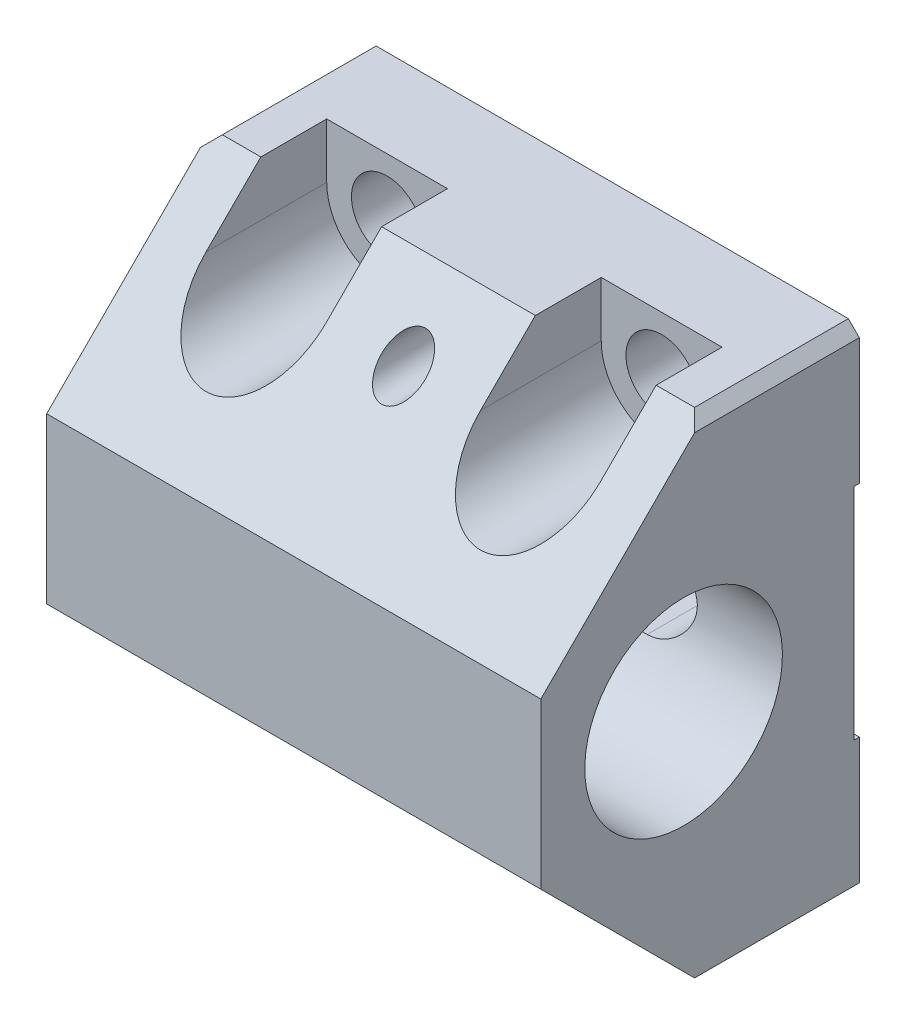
ISO-10303-21;
HEADER;
FILE_DESCRIPTION(('STEP AP214'),'2;1');
FILE_NAME('part.step','',(''),(''),'','','');
FILE_SCHEMA(('AUTOMOTIVE_DESIGN { 1 0 10303 214 1 1 1 1 }'));
ENDSEC;
DATA;
#1=APPLICATION_CONTEXT('core data for automotive mechanical design processes');
#2=APPLICATION_PROTOCOL_DEFINITION('international standard','automotive_design',2000,#1);
#3=PRODUCT_CONTEXT('',#1,'mechanical');
#4=PRODUCT('Part','Part','',(#3));
#5=PRODUCT_RELATED_PRODUCT_CATEGORY('part','',(#4));
#6=PRODUCT_DEFINITION_FORMATION('','',#4);
#7=PRODUCT_DEFINITION_CONTEXT('part definition',#1,'design');
#8=PRODUCT_DEFINITION('design','',#6,#7);
#9=PRODUCT_DEFINITION_SHAPE('','',#8);
#10=(LENGTH_UNIT() NAMED_UNIT(*) SI_UNIT(.MILLI.,.METRE.));
#11=(NAMED_UNIT(*) PLANE_ANGLE_UNIT() SI_UNIT($,.RADIAN.));
#12=(NAMED_UNIT(*) SI_UNIT($,.STERADIAN.) SOLID_ANGLE_UNIT());
#13=UNCERTAINTY_MEASURE_WITH_UNIT(LENGTH_MEASURE(1.E-05),#10,'distance_accuracy_value','');
#14=(GEOMETRIC_REPRESENTATION_CONTEXT(3) GLOBAL_UNCERTAINTY_ASSIGNED_CONTEXT((#13)) GLOBAL_UNIT_ASSIGNED_CONTEXT((#10,
#11,#12)) REPRESENTATION_CONTEXT('',''));
#15=CARTESIAN_POINT('',(0.,0.,0.));
#16=DIRECTION('',(0.,0.,1.));
#17=DIRECTION('',(1.,0.,0.));
#18=AXIS2_PLACEMENT_3D('',#15,#16,#17);
#19=CARTESIAN_POINT('',(-10.,-5.,0.));
#20=DIRECTION('',(0.,-1.,0.));
#21=DIRECTION('',(1.,0.,0.));
#22=AXIS2_PLACEMENT_3D('',#19,#20,#21);
#23=PLANE('',#22);
#24=DIRECTION('',(1.,0.,0.));
#25=VECTOR('',#24,1.);
#26=CARTESIAN_POINT('',(-10.,-5.,14.));
#27=LINE('',#26,#25);
#28=CARTESIAN_POINT('',(-9.,-5.,14.));
#29=VERTEX_POINT('',#28);
#30=CARTESIAN_POINT('',(-5.5,-5.,14.));
#31=VERTEX_POINT('',#30);
#32=EDGE_CURVE('E299',#29,#31,#27,.T.);
#33=ORIENTED_EDGE('',*,*,#32,.F.);
#34=DIRECTION('',(0.,0.,-1.));
#35=VECTOR('',#34,1.);
#36=CARTESIAN_POINT('',(-9.,-5.,0.));
#37=LINE('',#36,#35);
#38=CARTESIAN_POINT('',(-9.,-5.,0.));
#39=VERTEX_POINT('',#38);
#40=EDGE_CURVE('E302',#29,#39,#37,.T.);
#41=ORIENTED_EDGE('',*,*,#40,.T.);
#42=DIRECTION('',(1.,0.,0.));
#43=VECTOR('',#42,1.);
#44=CARTESIAN_POINT('',(-10.,-5.,0.));
#45=LINE('',#44,#43);
#46=CARTESIAN_POINT('',(34.,-5.,0.));
#47=VERTEX_POINT('',#46);
#48=EDGE_CURVE('E405',#39,#47,#45,.T.);
#49=ORIENTED_EDGE('',*,*,#48,.T.);
#50=DIRECTION('',(0.,0.,1.));
#51=VECTOR('',#50,1.);
#52=CARTESIAN_POINT('',(34.,-5.,14.));
#53=LINE('',#52,#51);
#54=CARTESIAN_POINT('',(34.,-5.,14.));
#55=VERTEX_POINT('',#54);
#56=EDGE_CURVE('E320',#47,#55,#53,.T.);
#57=ORIENTED_EDGE('',*,*,#56,.T.);
#58=CARTESIAN_POINT('',(30.5,-5.,14.));
#59=VERTEX_POINT('',#58);
#60=EDGE_CURVE('E312',#59,#55,#27,.T.);
#61=ORIENTED_EDGE('',*,*,#60,.F.);
#62=DIRECTION('',(0.,0.,1.));
#63=VECTOR('',#62,1.);
#64=CARTESIAN_POINT('',(30.5,-5.,8.));
#65=LINE('',#64,#63);
#66=CARTESIAN_POINT('',(30.5,-5.,8.));
#67=VERTEX_POINT('',#66);
#68=EDGE_CURVE('E493',#67,#59,#65,.T.);
#69=ORIENTED_EDGE('',*,*,#68,.F.);
#70=DIRECTION('',(1.,0.,0.));
#71=VECTOR('',#70,1.);
#72=CARTESIAN_POINT('',(19.5,-5.,8.));
#73=LINE('',#72,#71);
#74=CARTESIAN_POINT('',(19.5,-5.,8.));
#75=VERTEX_POINT('',#74);
#76=EDGE_CURVE('E499',#75,#67,#73,.T.);
#77=ORIENTED_EDGE('',*,*,#76,.F.);
#78=DIRECTION('',(0.,0.,1.));
#79=VECTOR('',#78,1.);
#80=CARTESIAN_POINT('',(19.5,-5.,8.));
#81=LINE('',#80,#79);
#82=CARTESIAN_POINT('',(19.5,-5.,14.));
#83=VERTEX_POINT('',#82);
#84=EDGE_CURVE('E489',#75,#83,#81,.T.);
#85=ORIENTED_EDGE('',*,*,#84,.T.);
#86=CARTESIAN_POINT('',(5.5,-5.,14.));
#87=VERTEX_POINT('',#86);
#88=EDGE_CURVE('E310',#87,#83,#27,.T.);
#89=ORIENTED_EDGE('',*,*,#88,.F.);
#90=DIRECTION('',(0.,0.,1.));
#91=VECTOR('',#90,1.);
#92=CARTESIAN_POINT('',(5.5,-5.,8.));
#93=LINE('',#92,#91);
#94=CARTESIAN_POINT('',(5.5,-5.,8.));
#95=VERTEX_POINT('',#94);
#96=EDGE_CURVE('E512',#95,#87,#93,.T.);
#97=ORIENTED_EDGE('',*,*,#96,.F.);
#98=DIRECTION('',(1.,0.,0.));
#99=VECTOR('',#98,1.);
#100=CARTESIAN_POINT('',(-5.5,-5.,8.));
#101=LINE('',#100,#99);
#102=CARTESIAN_POINT('',(-5.5,-5.,8.));
#103=VERTEX_POINT('',#102);
#104=EDGE_CURVE('E518',#103,#95,#101,.T.);
#105=ORIENTED_EDGE('',*,*,#104,.F.);
#106=DIRECTION('',(0.,0.,1.));
#107=VECTOR('',#106,1.);
#108=CARTESIAN_POINT('',(-5.5,-5.,8.));
#109=LINE('',#108,#107);
#110=EDGE_CURVE('E305',#103,#31,#109,.T.);
#111=ORIENTED_EDGE('',*,*,#110,.T.);
#112=EDGE_LOOP('',(#33,#41,#49,#57,#61,#69,#77,#85,#89,#97,#105,#111));
#113=FACE_BOUND('',#112,.T.);
#114=ADVANCED_FACE('F14',(#113),#23,.T.);
#115=CARTESIAN_POINT('',(-10.,10.,29.));
#116=DIRECTION('',(0.,-0.707106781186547,0.707106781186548));
#117=DIRECTION('',(0.,-0.707106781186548,-0.707106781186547));
#118=AXIS2_PLACEMENT_3D('',#115,#116,#117);
#119=PLANE('',#118);
#120=CARTESIAN_POINT('',(12.5,0.,19.));
#121=DIRECTION('',(0.,-0.707106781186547,0.707106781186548));
#122=DIRECTION('',(0.,-0.707106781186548,-0.707106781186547));
#123=AXIS2_PLACEMENT_3D('',#120,#121,#122);
#124=ELLIPSE('',#123,2.82842712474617,2.);
#125=CARTESIAN_POINT('',(12.5,-1.99999999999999,17.));
#126=VERTEX_POINT('',#125);
#127=EDGE_CURVE('E566',#126,#126,#124,.T.);
#128=ORIENTED_EDGE('',*,*,#127,.F.);
#129=EDGE_LOOP('',(#128));
#130=FACE_BOUND('',#129,.T.);
#131=DIRECTION('',(0.,-0.707106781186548,-0.707106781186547));
#132=VECTOR('',#131,1.);
#133=CARTESIAN_POINT('',(-10.,10.,29.));
#134=LINE('',#133,#132);
#135=CARTESIAN_POINT('',(-10.,10.,29.));
#136=VERTEX_POINT('',#135);
#137=CARTESIAN_POINT('',(-10.,-4.,15.));
#138=VERTEX_POINT('',#137);
#139=EDGE_CURVE('E402',#136,#138,#134,.T.);
#140=ORIENTED_EDGE('',*,*,#139,.T.);
#141=DIRECTION('',(-0.577350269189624,0.577350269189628,0.577350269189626));
#142=VECTOR('',#141,1.);
#143=CARTESIAN_POINT('',(-19.3333333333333,5.33333333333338,24.3333333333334));
#144=LINE('',#143,#142);
#145=EDGE_CURVE('E317',#138,#29,#144,.F.);
#146=ORIENTED_EDGE('',*,*,#145,.T.);
#147=ORIENTED_EDGE('',*,*,#32,.T.);
#148=DIRECTION('',(0.,-0.707106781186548,-0.707106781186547));
#149=VECTOR('',#148,1.);
#150=CARTESIAN_POINT('',(-5.5,10.,29.));
#151=LINE('',#150,#149);
#152=CARTESIAN_POINT('',(-5.5,0.,19.));
#153=VERTEX_POINT('',#152);
#154=EDGE_CURVE('E783',#153,#31,#151,.T.);
#155=ORIENTED_EDGE('',*,*,#154,.F.);
#156=CARTESIAN_POINT('',(0.,0.,19.));
#157=DIRECTION('',(0.,-0.707106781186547,0.707106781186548));
#158=DIRECTION('',(0.,0.707106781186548,0.707106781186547));
#159=AXIS2_PLACEMENT_3D('',#156,#157,#158);
#160=ELLIPSE('',#159,7.77817459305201,5.5);
#161=CARTESIAN_POINT('',(5.5,0.,19.));
#162=VERTEX_POINT('',#161);
#163=EDGE_CURVE('E785',#162,#153,#160,.T.);
#164=ORIENTED_EDGE('',*,*,#163,.F.);
#165=DIRECTION('',(0.,0.707106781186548,0.707106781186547));
#166=VECTOR('',#165,1.);
#167=CARTESIAN_POINT('',(5.5,10.,29.));
#168=LINE('',#167,#166);
#169=EDGE_CURVE('E323',#87,#162,#168,.T.);
#170=ORIENTED_EDGE('',*,*,#169,.F.);
#171=ORIENTED_EDGE('',*,*,#88,.T.);
#172=DIRECTION('',(0.,-0.707106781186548,-0.707106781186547));
#173=VECTOR('',#172,1.);
#174=CARTESIAN_POINT('',(19.5,10.,29.));
#175=LINE('',#174,#173);
#176=CARTESIAN_POINT('',(19.5,0.,19.));
#177=VERTEX_POINT('',#176);
#178=EDGE_CURVE('E775',#177,#83,#175,.T.);
#179=ORIENTED_EDGE('',*,*,#178,.F.);
#180=CARTESIAN_POINT('',(25.,0.,19.));
#181=DIRECTION('',(0.,-0.707106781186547,0.707106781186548));
#182=DIRECTION('',(0.,0.707106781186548,0.707106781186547));
#183=AXIS2_PLACEMENT_3D('',#180,#181,#182);
#184=ELLIPSE('',#183,7.77817459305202,5.5);
#185=CARTESIAN_POINT('',(30.5,0.,19.));
#186=VERTEX_POINT('',#185);
#187=EDGE_CURVE('E778',#186,#177,#184,.T.);
#188=ORIENTED_EDGE('',*,*,#187,.F.);
#189=DIRECTION('',(0.,0.707106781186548,0.707106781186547));
#190=VECTOR('',#189,1.);
#191=CARTESIAN_POINT('',(30.5,10.,29.));
#192=LINE('',#191,#190);
#193=EDGE_CURVE('E781',#59,#186,#192,.T.);
#194=ORIENTED_EDGE('',*,*,#193,.F.);
#195=ORIENTED_EDGE('',*,*,#60,.T.);
#196=DIRECTION('',(0.577350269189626,0.577350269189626,0.577350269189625));
#197=VECTOR('',#196,1.);
#198=CARTESIAN_POINT('',(29.3333333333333,-9.6666666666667,9.33333333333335));
#199=LINE('',#198,#197);
#200=CARTESIAN_POINT('',(35.,-4.,15.));
#201=VERTEX_POINT('',#200);
#202=EDGE_CURVE('E332',#55,#201,#199,.T.);
#203=ORIENTED_EDGE('',*,*,#202,.T.);
#204=DIRECTION('',(0.,-0.707106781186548,-0.707106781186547));
#205=VECTOR('',#204,1.);
#206=CARTESIAN_POINT('',(35.,10.,29.));
#207=LINE('',#206,#205);
#208=CARTESIAN_POINT('',(35.,10.,29.));
#209=VERTEX_POINT('',#208);
#210=EDGE_CURVE('E424',#209,#201,#207,.T.);
#211=ORIENTED_EDGE('',*,*,#210,.F.);
#212=DIRECTION('',(1.,0.,0.));
#213=VECTOR('',#212,1.);
#214=CARTESIAN_POINT('',(-10.,10.,29.));
#215=LINE('',#214,#213);
#216=EDGE_CURVE('E397',#136,#209,#215,.T.);
#217=ORIENTED_EDGE('',*,*,#216,.F.);
#218=EDGE_LOOP('',(#140,#146,#147,#155,#164,#170,#171,#179,#188,#194,#195,#203,#211,#217));
#219=FACE_BOUND('',#218,.T.);
#220=ADVANCED_FACE('F287',(#130,#219),#119,.T.);
#221=CARTESIAN_POINT('',(-10.,10.,29.));
#222=DIRECTION('',(0.,0.,1.));
#223=DIRECTION('',(1.,0.,0.));
#224=AXIS2_PLACEMENT_3D('',#221,#222,#223);
#225=PLANE('',#224);
#226=DIRECTION('',(0.,-1.,0.));
#227=VECTOR('',#226,1.);
#228=CARTESIAN_POINT('',(35.,10.,29.));
#229=LINE('',#228,#227);
#230=CARTESIAN_POINT('',(35.,25.,29.));
#231=VERTEX_POINT('',#230);
#232=EDGE_CURVE('E426',#231,#209,#229,.T.);
#233=ORIENTED_EDGE('',*,*,#232,.F.);
#234=DIRECTION('',(1.,0.,0.));
#235=VECTOR('',#234,1.);
#236=CARTESIAN_POINT('',(-10.,25.,29.));
#237=LINE('',#236,#235);
#238=CARTESIAN_POINT('',(-10.,25.,29.));
#239=VERTEX_POINT('',#238);
#240=EDGE_CURVE('E394',#239,#231,#237,.T.);
#241=ORIENTED_EDGE('',*,*,#240,.F.);
#242=DIRECTION('',(0.,-1.,0.));
#243=VECTOR('',#242,1.);
#244=CARTESIAN_POINT('',(-10.,10.,29.));
#245=LINE('',#244,#243);
#246=EDGE_CURVE('E406',#239,#136,#245,.T.);
#247=ORIENTED_EDGE('',*,*,#246,.T.);
#248=ORIENTED_EDGE('',*,*,#216,.T.);
#249=EDGE_LOOP('',(#233,#241,#247,#248));
#250=FACE_BOUND('',#249,.T.);
#251=ADVANCED_FACE('F293',(#250),#225,.T.);
#252=CARTESIAN_POINT('',(-10.,25.,29.));
#253=DIRECTION('',(0.,0.707106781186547,0.707106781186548));
#254=DIRECTION('',(0.,-0.707106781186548,0.707106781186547));
#255=AXIS2_PLACEMENT_3D('',#252,#253,#254);
#256=PLANE('',#255);
#257=CARTESIAN_POINT('',(12.5,35.,19.));
#258=DIRECTION('',(0.,0.707106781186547,0.707106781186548));
#259=DIRECTION('',(0.,0.707106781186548,-0.707106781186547));
#260=AXIS2_PLACEMENT_3D('',#257,#258,#259);
#261=ELLIPSE('',#260,2.82842712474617,2.);
#262=CARTESIAN_POINT('',(12.5,37.,17.));
#263=VERTEX_POINT('',#262);
#264=EDGE_CURVE('E574',#263,#263,#261,.T.);
#265=ORIENTED_EDGE('',*,*,#264,.F.);
#266=EDGE_LOOP('',(#265));
#267=FACE_BOUND('',#266,.T.);
#268=DIRECTION('',(1.,0.,0.));
#269=VECTOR('',#268,1.);
#270=CARTESIAN_POINT('',(-10.,40.,14.));
#271=LINE('',#270,#269);
#272=CARTESIAN_POINT('',(-9.,40.,14.));
#273=VERTEX_POINT('',#272);
#274=CARTESIAN_POINT('',(-5.5,40.,14.));
#275=VERTEX_POINT('',#274);
#276=EDGE_CURVE('E389',#273,#275,#271,.T.);
#277=ORIENTED_EDGE('',*,*,#276,.F.);
#278=DIRECTION('',(0.577350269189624,0.577350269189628,-0.577350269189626));
#279=VECTOR('',#278,1.);
#280=CARTESIAN_POINT('',(-19.3333333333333,29.6666666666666,24.3333333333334));
#281=LINE('',#280,#279);
#282=CARTESIAN_POINT('',(-10.,39.,15.));
#283=VERTEX_POINT('',#282);
#284=EDGE_CURVE('E348',#273,#283,#281,.F.);
#285=ORIENTED_EDGE('',*,*,#284,.T.);
#286=DIRECTION('',(0.,-0.707106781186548,0.707106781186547));
#287=VECTOR('',#286,1.);
#288=CARTESIAN_POINT('',(-10.,25.,29.));
#289=LINE('',#288,#287);
#290=EDGE_CURVE('E409',#283,#239,#289,.T.);
#291=ORIENTED_EDGE('',*,*,#290,.T.);
#292=ORIENTED_EDGE('',*,*,#240,.T.);
#293=DIRECTION('',(0.,-0.707106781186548,0.707106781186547));
#294=VECTOR('',#293,1.);
#295=CARTESIAN_POINT('',(35.,25.,29.));
#296=LINE('',#295,#294);
#297=CARTESIAN_POINT('',(35.,39.,15.));
#298=VERTEX_POINT('',#297);
#299=EDGE_CURVE('E370',#298,#231,#296,.T.);
#300=ORIENTED_EDGE('',*,*,#299,.F.);
#301=DIRECTION('',(-0.577350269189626,0.577350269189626,-0.577350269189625));
#302=VECTOR('',#301,1.);
#303=CARTESIAN_POINT('',(29.3333333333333,44.6666666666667,9.33333333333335));
#304=LINE('',#303,#302);
#305=CARTESIAN_POINT('',(34.,40.,14.));
#306=VERTEX_POINT('',#305);
#307=EDGE_CURVE('E346',#298,#306,#304,.T.);
#308=ORIENTED_EDGE('',*,*,#307,.T.);
#309=CARTESIAN_POINT('',(30.5,40.,14.));
#310=VERTEX_POINT('',#309);
#311=EDGE_CURVE('E379',#310,#306,#271,.T.);
#312=ORIENTED_EDGE('',*,*,#311,.F.);
#313=DIRECTION('',(0.,0.707106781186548,-0.707106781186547));
#314=VECTOR('',#313,1.);
#315=CARTESIAN_POINT('',(30.5,25.,29.));
#316=LINE('',#315,#314);
#317=CARTESIAN_POINT('',(30.5,35.,19.));
#318=VERTEX_POINT('',#317);
#319=EDGE_CURVE('E465',#318,#310,#316,.T.);
#320=ORIENTED_EDGE('',*,*,#319,.F.);
#321=CARTESIAN_POINT('',(25.,35.,19.));
#322=DIRECTION('',(0.,0.707106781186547,0.707106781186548));
#323=DIRECTION('',(0.,-0.707106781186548,0.707106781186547));
#324=AXIS2_PLACEMENT_3D('',#321,#322,#323);
#325=ELLIPSE('',#324,7.77817459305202,5.5);
#326=CARTESIAN_POINT('',(19.5,35.,19.));
#327=VERTEX_POINT('',#326);
#328=EDGE_CURVE('E773',#327,#318,#325,.T.);
#329=ORIENTED_EDGE('',*,*,#328,.F.);
#330=DIRECTION('',(0.,-0.707106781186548,0.707106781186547));
#331=VECTOR('',#330,1.);
#332=CARTESIAN_POINT('',(19.5,25.,29.));
#333=LINE('',#332,#331);
#334=CARTESIAN_POINT('',(19.5,40.,14.));
#335=VERTEX_POINT('',#334);
#336=EDGE_CURVE('E463',#335,#327,#333,.T.);
#337=ORIENTED_EDGE('',*,*,#336,.F.);
#338=CARTESIAN_POINT('',(5.5,40.,14.));
#339=VERTEX_POINT('',#338);
#340=EDGE_CURVE('E387',#339,#335,#271,.T.);
#341=ORIENTED_EDGE('',*,*,#340,.F.);
#342=DIRECTION('',(0.,0.707106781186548,-0.707106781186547));
#343=VECTOR('',#342,1.);
#344=CARTESIAN_POINT('',(5.5,25.,29.));
#345=LINE('',#344,#343);
#346=CARTESIAN_POINT('',(5.5,35.,19.));
#347=VERTEX_POINT('',#346);
#348=EDGE_CURVE('E440',#347,#339,#345,.T.);
#349=ORIENTED_EDGE('',*,*,#348,.F.);
#350=CARTESIAN_POINT('',(0.,35.,19.));
#351=DIRECTION('',(0.,0.707106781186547,0.707106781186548));
#352=DIRECTION('',(0.,-0.707106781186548,0.707106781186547));
#353=AXIS2_PLACEMENT_3D('',#350,#351,#352);
#354=ELLIPSE('',#353,7.77817459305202,5.5);
#355=CARTESIAN_POINT('',(-5.5,35.,19.));
#356=VERTEX_POINT('',#355);
#357=EDGE_CURVE('E309',#356,#347,#354,.T.);
#358=ORIENTED_EDGE('',*,*,#357,.F.);
#359=DIRECTION('',(0.,-0.707106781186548,0.707106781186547));
#360=VECTOR('',#359,1.);
#361=CARTESIAN_POINT('',(-5.5,25.,29.));
#362=LINE('',#361,#360);
#363=EDGE_CURVE('E438',#275,#356,#362,.T.);
#364=ORIENTED_EDGE('',*,*,#363,.F.);
#365=EDGE_LOOP('',(#277,#285,#291,#292,#300,#308,#312,#320,#329,#337,#341,#349,#358,#364));
#366=FACE_BOUND('',#365,.T.);
#367=ADVANCED_FACE('F377',(#267,#366),#256,.T.);
#368=CARTESIAN_POINT('',(-10.,40.,0.));
#369=DIRECTION('',(0.,1.,0.));
#370=DIRECTION('',(-1.,0.,0.));
#371=AXIS2_PLACEMENT_3D('',#368,#369,#370);
#372=PLANE('',#371);
#373=DIRECTION('',(1.,0.,0.));
#374=VECTOR('',#373,1.);
#375=CARTESIAN_POINT('',(-10.,40.,0.));
#376=LINE('',#375,#374);
#377=CARTESIAN_POINT('',(-9.,40.,0.));
#378=VERTEX_POINT('',#377);
#379=CARTESIAN_POINT('',(34.,40.,0.));
#380=VERTEX_POINT('',#379);
#381=EDGE_CURVE('E359',#378,#380,#376,.T.);
#382=ORIENTED_EDGE('',*,*,#381,.F.);
#383=DIRECTION('',(0.,0.,1.));
#384=VECTOR('',#383,1.);
#385=CARTESIAN_POINT('',(-9.,40.,0.));
#386=LINE('',#385,#384);
#387=EDGE_CURVE('E343',#378,#273,#386,.T.);
#388=ORIENTED_EDGE('',*,*,#387,.T.);
#389=ORIENTED_EDGE('',*,*,#276,.T.);
#390=DIRECTION('',(0.,0.,1.));
#391=VECTOR('',#390,1.);
#392=CARTESIAN_POINT('',(-5.5,40.,8.));
#393=LINE('',#392,#391);
#394=CARTESIAN_POINT('',(-5.5,40.,8.));
#395=VERTEX_POINT('',#394);
#396=EDGE_CURVE('E450',#395,#275,#393,.T.);
#397=ORIENTED_EDGE('',*,*,#396,.F.);
#398=DIRECTION('',(-1.,0.,0.));
#399=VECTOR('',#398,1.);
#400=CARTESIAN_POINT('',(-5.5,40.,8.));
#401=LINE('',#400,#399);
#402=CARTESIAN_POINT('',(5.5,40.,8.));
#403=VERTEX_POINT('',#402);
#404=EDGE_CURVE('E456',#403,#395,#401,.T.);
#405=ORIENTED_EDGE('',*,*,#404,.F.);
#406=DIRECTION('',(0.,0.,1.));
#407=VECTOR('',#406,1.);
#408=CARTESIAN_POINT('',(5.5,40.,8.));
#409=LINE('',#408,#407);
#410=EDGE_CURVE('E446',#403,#339,#409,.T.);
#411=ORIENTED_EDGE('',*,*,#410,.T.);
#412=ORIENTED_EDGE('',*,*,#340,.T.);
#413=DIRECTION('',(0.,0.,1.));
#414=VECTOR('',#413,1.);
#415=CARTESIAN_POINT('',(19.5,40.,8.));
#416=LINE('',#415,#414);
#417=CARTESIAN_POINT('',(19.5,40.,8.));
#418=VERTEX_POINT('',#417);
#419=EDGE_CURVE('E473',#418,#335,#416,.T.);
#420=ORIENTED_EDGE('',*,*,#419,.F.);
#421=DIRECTION('',(-1.,0.,0.));
#422=VECTOR('',#421,1.);
#423=CARTESIAN_POINT('',(19.5,40.,8.));
#424=LINE('',#423,#422);
#425=CARTESIAN_POINT('',(30.5,40.,8.));
#426=VERTEX_POINT('',#425);
#427=EDGE_CURVE('E479',#426,#418,#424,.T.);
#428=ORIENTED_EDGE('',*,*,#427,.F.);
#429=DIRECTION('',(0.,0.,1.));
#430=VECTOR('',#429,1.);
#431=CARTESIAN_POINT('',(30.5,40.,8.));
#432=LINE('',#431,#430);
#433=EDGE_CURVE('E386',#426,#310,#432,.T.);
#434=ORIENTED_EDGE('',*,*,#433,.T.);
#435=ORIENTED_EDGE('',*,*,#311,.T.);
#436=DIRECTION('',(0.,0.,-1.));
#437=VECTOR('',#436,1.);
#438=CARTESIAN_POINT('',(34.,40.,0.));
#439=LINE('',#438,#437);
#440=EDGE_CURVE('E341',#306,#380,#439,.T.);
#441=ORIENTED_EDGE('',*,*,#440,.T.);
#442=EDGE_LOOP('',(#382,#388,#389,#397,#405,#411,#412,#420,#428,#434,#435,#441));
#443=FACE_BOUND('',#442,.T.);
#444=ADVANCED_FACE('F383',(#443),#372,.T.);
#445=CARTESIAN_POINT('',(-10.,27.5,0.));
#446=DIRECTION('',(0.,0.,-1.));
#447=DIRECTION('',(0.,1.,0.));
#448=AXIS2_PLACEMENT_3D('',#445,#446,#447);
#449=PLANE('',#448);
#450=CARTESIAN_POINT('',(12.5,35.,0.));
#451=DIRECTION('',(0.,0.,-1.));
#452=DIRECTION('',(-1.,0.,0.));
#453=AXIS2_PLACEMENT_3D('',#450,#451,#452);
#454=CIRCLE('',#453,2.);
#455=CARTESIAN_POINT('',(10.5,35.,0.));
#456=VERTEX_POINT('',#455);
#457=EDGE_CURVE('E247',#456,#456,#454,.T.);
#458=ORIENTED_EDGE('',*,*,#457,.F.);
#459=EDGE_LOOP('',(#458));
#460=FACE_BOUND('',#459,.T.);
#461=CARTESIAN_POINT('',(0.,35.,0.));
#462=DIRECTION('',(0.,0.,-1.));
#463=DIRECTION('',(0.,1.,0.));
#464=AXIS2_PLACEMENT_3D('',#461,#462,#463);
#465=CIRCLE('',#464,3.25);
#466=CARTESIAN_POINT('',(0.,38.25,0.));
#467=VERTEX_POINT('',#466);
#468=EDGE_CURVE('E551',#467,#467,#465,.F.);
#469=ORIENTED_EDGE('',*,*,#468,.T.);
#470=EDGE_LOOP('',(#469));
#471=FACE_BOUND('',#470,.T.);
#472=CARTESIAN_POINT('',(25.,35.,0.));
#473=DIRECTION('',(0.,0.,-1.));
#474=DIRECTION('',(0.,1.,0.));
#475=AXIS2_PLACEMENT_3D('',#472,#473,#474);
#476=CIRCLE('',#475,3.25);
#477=CARTESIAN_POINT('',(25.,38.25,0.));
#478=VERTEX_POINT('',#477);
#479=EDGE_CURVE('E545',#478,#478,#476,.F.);
#480=ORIENTED_EDGE('',*,*,#479,.T.);
#481=EDGE_LOOP('',(#480));
#482=FACE_BOUND('',#481,.T.);
#483=DIRECTION('',(0.,1.,0.));
#484=VECTOR('',#483,1.);
#485=CARTESIAN_POINT('',(-10.,27.5,0.));
#486=LINE('',#485,#484);
#487=CARTESIAN_POINT('',(-10.,27.5,0.));
#488=VERTEX_POINT('',#487);
#489=CARTESIAN_POINT('',(-10.,39.,0.));
#490=VERTEX_POINT('',#489);
#491=EDGE_CURVE('E411',#488,#490,#486,.T.);
#492=ORIENTED_EDGE('',*,*,#491,.T.);
#493=DIRECTION('',(-0.707106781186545,-0.70710678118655,0.));
#494=VECTOR('',#493,1.);
#495=CARTESIAN_POINT('',(-15.75,33.25,0.));
#496=LINE('',#495,#494);
#497=EDGE_CURVE('E9',#490,#378,#496,.F.);
#498=ORIENTED_EDGE('',*,*,#497,.T.);
#499=ORIENTED_EDGE('',*,*,#381,.T.);
#500=DIRECTION('',(0.707106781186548,-0.707106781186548,0.));
#501=VECTOR('',#500,1.);
#502=CARTESIAN_POINT('',(18.25,55.75,0.));
#503=LINE('',#502,#501);
#504=CARTESIAN_POINT('',(35.,39.,0.));
#505=VERTEX_POINT('',#504);
#506=EDGE_CURVE('E21',#380,#505,#503,.T.);
#507=ORIENTED_EDGE('',*,*,#506,.T.);
#508=DIRECTION('',(0.,1.,0.));
#509=VECTOR('',#508,1.);
#510=CARTESIAN_POINT('',(35.,27.5,0.));
#511=LINE('',#510,#509);
#512=CARTESIAN_POINT('',(35.,27.5,0.));
#513=VERTEX_POINT('',#512);
#514=EDGE_CURVE('E356',#513,#505,#511,.T.);
#515=ORIENTED_EDGE('',*,*,#514,.F.);
#516=DIRECTION('',(1.,0.,0.));
#517=VECTOR('',#516,1.);
#518=CARTESIAN_POINT('',(-10.,27.5,0.));
#519=LINE('',#518,#517);
#520=EDGE_CURVE('E391',#488,#513,#519,.T.);
#521=ORIENTED_EDGE('',*,*,#520,.F.);
#522=EDGE_LOOP('',(#492,#498,#499,#507,#515,#521));
#523=FACE_BOUND('',#522,.T.);
#524=ADVANCED_FACE('F355',(#460,#471,#482,#523),#449,.T.);
#525=CARTESIAN_POINT('',(-10.,27.5,0.));
#526=DIRECTION('',(0.,-1.,0.));
#527=DIRECTION('',(0.,0.,-1.));
#528=AXIS2_PLACEMENT_3D('',#525,#526,#527);
#529=PLANE('',#528);
#530=DIRECTION('',(0.,0.,-1.));
#531=VECTOR('',#530,1.);
#532=CARTESIAN_POINT('',(35.,27.5,0.));
#533=LINE('',#532,#531);
#534=CARTESIAN_POINT('',(35.,27.5,0.5));
#535=VERTEX_POINT('',#534);
#536=EDGE_CURVE('E369',#535,#513,#533,.T.);
#537=ORIENTED_EDGE('',*,*,#536,.F.);
#538=DIRECTION('',(1.,0.,0.));
#539=VECTOR('',#538,1.);
#540=CARTESIAN_POINT('',(-10.,27.5,0.5));
#541=LINE('',#540,#539);
#542=CARTESIAN_POINT('',(-10.,27.5,0.5));
#543=VERTEX_POINT('',#542);
#544=EDGE_CURVE('E810',#543,#535,#541,.T.);
#545=ORIENTED_EDGE('',*,*,#544,.F.);
#546=DIRECTION('',(0.,0.,-1.));
#547=VECTOR('',#546,1.);
#548=CARTESIAN_POINT('',(-10.,27.5,0.));
#549=LINE('',#548,#547);
#550=EDGE_CURVE('E413',#543,#488,#549,.T.);
#551=ORIENTED_EDGE('',*,*,#550,.T.);
#552=ORIENTED_EDGE('',*,*,#520,.T.);
#553=EDGE_LOOP('',(#537,#545,#551,#552));
#554=FACE_BOUND('',#553,.T.);
#555=ADVANCED_FACE('F741',(#554),#529,.T.);
#556=CARTESIAN_POINT('',(-10.,7.5,0.5));
#557=DIRECTION('',(0.,0.,-1.));
#558=DIRECTION('',(0.,1.,0.));
#559=AXIS2_PLACEMENT_3D('',#556,#557,#558);
#560=PLANE('',#559);
#561=CARTESIAN_POINT('',(23.5,17.5,0.5));
#562=DIRECTION('',(0.,0.,-1.));
#563=DIRECTION('',(0.,1.,0.));
#564=AXIS2_PLACEMENT_3D('',#561,#562,#563);
#565=CIRCLE('',#564,3.75);
#566=CARTESIAN_POINT('',(23.5,21.25,0.5));
#567=VERTEX_POINT('',#566);
#568=CARTESIAN_POINT('',(23.5,13.75,0.5));
#569=VERTEX_POINT('',#568);
#570=EDGE_CURVE('E28',#567,#569,#565,.T.);
#571=ORIENTED_EDGE('',*,*,#570,.F.);
#572=DIRECTION('',(1.,0.,0.));
#573=VECTOR('',#572,1.);
#574=CARTESIAN_POINT('',(23.5,21.25,0.5));
#575=LINE('',#574,#573);
#576=CARTESIAN_POINT('',(11.5,21.25,0.5));
#577=VERTEX_POINT('',#576);
#578=EDGE_CURVE('E241',#577,#567,#575,.T.);
#579=ORIENTED_EDGE('',*,*,#578,.F.);
#580=CARTESIAN_POINT('',(11.5,17.5,0.5));
#581=DIRECTION('',(0.,0.,-1.));
#582=DIRECTION('',(0.,-1.,0.));
#583=AXIS2_PLACEMENT_3D('',#580,#581,#582);
#584=CIRCLE('',#583,3.75);
#585=CARTESIAN_POINT('',(11.5,13.75,0.5));
#586=VERTEX_POINT('',#585);
#587=EDGE_CURVE('E585',#586,#577,#584,.T.);
#588=ORIENTED_EDGE('',*,*,#587,.F.);
#589=DIRECTION('',(-1.,0.,0.));
#590=VECTOR('',#589,1.);
#591=CARTESIAN_POINT('',(23.5,13.75,0.5));
#592=LINE('',#591,#590);
#593=EDGE_CURVE('E255',#569,#586,#592,.T.);
#594=ORIENTED_EDGE('',*,*,#593,.F.);
#595=EDGE_LOOP('',(#571,#579,#588,#594));
#596=FACE_BOUND('',#595,.T.);
#597=DIRECTION('',(0.,1.,0.));
#598=VECTOR('',#597,1.);
#599=CARTESIAN_POINT('',(35.,7.5,0.5));
#600=LINE('',#599,#598);
#601=CARTESIAN_POINT('',(35.,7.5,0.5));
#602=VERTEX_POINT('',#601);
#603=EDGE_CURVE('E431',#602,#535,#600,.T.);
#604=ORIENTED_EDGE('',*,*,#603,.F.);
#605=DIRECTION('',(1.,0.,0.));
#606=VECTOR('',#605,1.);
#607=CARTESIAN_POINT('',(-10.,7.5,0.5));
#608=LINE('',#607,#606);
#609=CARTESIAN_POINT('',(-10.,7.5,0.5));
#610=VERTEX_POINT('',#609);
#611=EDGE_CURVE('E768',#610,#602,#608,.T.);
#612=ORIENTED_EDGE('',*,*,#611,.F.);
#613=DIRECTION('',(0.,1.,0.));
#614=VECTOR('',#613,1.);
#615=CARTESIAN_POINT('',(-10.,7.5,0.5));
#616=LINE('',#615,#614);
#617=EDGE_CURVE('E416',#610,#543,#616,.T.);
#618=ORIENTED_EDGE('',*,*,#617,.T.);
#619=ORIENTED_EDGE('',*,*,#544,.T.);
#620=EDGE_LOOP('',(#604,#612,#618,#619));
#621=FACE_BOUND('',#620,.T.);
#622=ADVANCED_FACE('F590',(#596,#621),#560,.T.);
#623=CARTESIAN_POINT('',(-10.,7.5,0.));
#624=DIRECTION('',(0.,1.,0.));
#625=DIRECTION('',(-1.,0.,0.));
#626=AXIS2_PLACEMENT_3D('',#623,#624,#625);
#627=PLANE('',#626);
#628=DIRECTION('',(0.,0.,1.));
#629=VECTOR('',#628,1.);
#630=CARTESIAN_POINT('',(35.,7.5,0.));
#631=LINE('',#630,#629);
#632=CARTESIAN_POINT('',(35.,7.5,0.));
#633=VERTEX_POINT('',#632);
#634=EDGE_CURVE('E433',#633,#602,#631,.T.);
#635=ORIENTED_EDGE('',*,*,#634,.F.);
#636=DIRECTION('',(1.,0.,0.));
#637=VECTOR('',#636,1.);
#638=CARTESIAN_POINT('',(-10.,7.5,0.));
#639=LINE('',#638,#637);
#640=CARTESIAN_POINT('',(-10.,7.5,0.));
#641=VERTEX_POINT('',#640);
#642=EDGE_CURVE('E765',#641,#633,#639,.T.);
#643=ORIENTED_EDGE('',*,*,#642,.F.);
#644=DIRECTION('',(0.,0.,1.));
#645=VECTOR('',#644,1.);
#646=CARTESIAN_POINT('',(-10.,7.5,0.));
#647=LINE('',#646,#645);
#648=EDGE_CURVE('E419',#641,#610,#647,.T.);
#649=ORIENTED_EDGE('',*,*,#648,.T.);
#650=ORIENTED_EDGE('',*,*,#611,.T.);
#651=EDGE_LOOP('',(#635,#643,#649,#650));
#652=FACE_BOUND('',#651,.T.);
#653=ADVANCED_FACE('F748',(#652),#627,.T.);
#654=CARTESIAN_POINT('',(-10.,-5.,0.));
#655=DIRECTION('',(0.,0.,-1.));
#656=DIRECTION('',(-1.,0.,0.));
#657=AXIS2_PLACEMENT_3D('',#654,#655,#656);
#658=PLANE('',#657);
#659=CARTESIAN_POINT('',(12.5,0.,0.));
#660=DIRECTION('',(0.,0.,-1.));
#661=DIRECTION('',(-1.,0.,0.));
#662=AXIS2_PLACEMENT_3D('',#659,#660,#661);
#663=CIRCLE('',#662,2.);
#664=CARTESIAN_POINT('',(10.5,0.,0.));
#665=VERTEX_POINT('',#664);
#666=EDGE_CURVE('E571',#665,#665,#663,.T.);
#667=ORIENTED_EDGE('',*,*,#666,.F.);
#668=EDGE_LOOP('',(#667));
#669=FACE_BOUND('',#668,.T.);
#670=CARTESIAN_POINT('',(0.,0.,0.));
#671=DIRECTION('',(0.,0.,-1.));
#672=DIRECTION('',(-1.,0.,0.));
#673=AXIS2_PLACEMENT_3D('',#670,#671,#672);
#674=CIRCLE('',#673,3.25);
#675=CARTESIAN_POINT('',(-3.25,0.,0.));
#676=VERTEX_POINT('',#675);
#677=EDGE_CURVE('E563',#676,#676,#674,.F.);
#678=ORIENTED_EDGE('',*,*,#677,.T.);
#679=EDGE_LOOP('',(#678));
#680=FACE_BOUND('',#679,.T.);
#681=CARTESIAN_POINT('',(25.,0.,0.));
#682=DIRECTION('',(0.,0.,-1.));
#683=DIRECTION('',(-1.,0.,0.));
#684=AXIS2_PLACEMENT_3D('',#681,#682,#683);
#685=CIRCLE('',#684,3.25);
#686=CARTESIAN_POINT('',(21.75,0.,0.));
#687=VERTEX_POINT('',#686);
#688=EDGE_CURVE('E557',#687,#687,#685,.F.);
#689=ORIENTED_EDGE('',*,*,#688,.T.);
#690=EDGE_LOOP('',(#689));
#691=FACE_BOUND('',#690,.T.);
#692=ORIENTED_EDGE('',*,*,#48,.F.);
#693=DIRECTION('',(0.707106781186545,-0.70710678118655,0.));
#694=VECTOR('',#693,1.);
#695=CARTESIAN_POINT('',(-9.5,-4.5,0.));
#696=LINE('',#695,#694);
#697=CARTESIAN_POINT('',(-10.,-4.,0.));
#698=VERTEX_POINT('',#697);
#699=EDGE_CURVE('E318',#39,#698,#696,.F.);
#700=ORIENTED_EDGE('',*,*,#699,.T.);
#701=DIRECTION('',(0.,1.,0.));
#702=VECTOR('',#701,1.);
#703=CARTESIAN_POINT('',(-10.,-5.,0.));
#704=LINE('',#703,#702);
#705=EDGE_CURVE('E422',#698,#641,#704,.T.);
#706=ORIENTED_EDGE('',*,*,#705,.T.);
#707=ORIENTED_EDGE('',*,*,#642,.T.);
#708=DIRECTION('',(0.,1.,0.));
#709=VECTOR('',#708,1.);
#710=CARTESIAN_POINT('',(35.,-5.,0.));
#711=LINE('',#710,#709);
#712=CARTESIAN_POINT('',(35.,-4.,0.));
#713=VERTEX_POINT('',#712);
#714=EDGE_CURVE('E436',#713,#633,#711,.T.);
#715=ORIENTED_EDGE('',*,*,#714,.F.);
#716=DIRECTION('',(-0.707106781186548,-0.707106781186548,0.));
#717=VECTOR('',#716,1.);
#718=CARTESIAN_POINT('',(12.,-27.,0.));
#719=LINE('',#718,#717);
#720=EDGE_CURVE('E319',#713,#47,#719,.T.);
#721=ORIENTED_EDGE('',*,*,#720,.T.);
#722=EDGE_LOOP('',(#692,#700,#706,#707,#715,#721));
#723=FACE_BOUND('',#722,.T.);
#724=ADVANCED_FACE('F728',(#669,#680,#691,#723),#658,.T.);
#725=CARTESIAN_POINT('',(-10.,-5.,29.));
#726=DIRECTION('',(-1.,0.,0.));
#727=DIRECTION('',(0.,-1.,0.));
#728=AXIS2_PLACEMENT_3D('',#725,#726,#727);
#729=PLANE('',#728);
#730=CARTESIAN_POINT('',(-10.,17.5,16.));
#731=DIRECTION('',(-1.,0.,0.));
#732=DIRECTION('',(0.,-1.,0.));
#733=AXIS2_PLACEMENT_3D('',#730,#731,#732);
#734=CIRCLE('',#733,5.5);
#735=CARTESIAN_POINT('',(-10.,12.,16.));
#736=VERTEX_POINT('',#735);
#737=EDGE_CURVE('E535',#736,#736,#734,.T.);
#738=ORIENTED_EDGE('',*,*,#737,.F.);
#739=EDGE_LOOP('',(#738));
#740=FACE_BOUND('',#739,.T.);
#741=ORIENTED_EDGE('',*,*,#705,.F.);
#742=DIRECTION('',(0.,0.,1.));
#743=VECTOR('',#742,1.);
#744=CARTESIAN_POINT('',(-10.,-4.,29.));
#745=LINE('',#744,#743);
#746=EDGE_CURVE('E330',#698,#138,#745,.T.);
#747=ORIENTED_EDGE('',*,*,#746,.T.);
#748=ORIENTED_EDGE('',*,*,#139,.F.);
#749=ORIENTED_EDGE('',*,*,#246,.F.);
#750=ORIENTED_EDGE('',*,*,#290,.F.);
#751=DIRECTION('',(0.,0.,-1.));
#752=VECTOR('',#751,1.);
#753=CARTESIAN_POINT('',(-10.,39.,29.));
#754=LINE('',#753,#752);
#755=EDGE_CURVE('E328',#283,#490,#754,.T.);
#756=ORIENTED_EDGE('',*,*,#755,.T.);
#757=ORIENTED_EDGE('',*,*,#491,.F.);
#758=ORIENTED_EDGE('',*,*,#550,.F.);
#759=ORIENTED_EDGE('',*,*,#617,.F.);
#760=ORIENTED_EDGE('',*,*,#648,.F.);
#761=EDGE_LOOP('',(#741,#747,#748,#749,#750,#756,#757,#758,#759,#760));
#762=FACE_BOUND('',#761,.T.);
#763=ADVANCED_FACE('F725',(#740,#762),#729,.T.);
#764=CARTESIAN_POINT('',(35.,-5.,29.));
#765=DIRECTION('',(-1.,0.,0.));
#766=DIRECTION('',(0.,-1.,0.));
#767=AXIS2_PLACEMENT_3D('',#764,#765,#766);
#768=PLANE('',#767);
#769=CARTESIAN_POINT('',(35.,17.5,16.));
#770=DIRECTION('',(1.,0.,0.));
#771=DIRECTION('',(0.,1.,0.));
#772=AXIS2_PLACEMENT_3D('',#769,#770,#771);
#773=CIRCLE('',#772,9.);
#774=CARTESIAN_POINT('',(35.,26.5,16.));
#775=VERTEX_POINT('',#774);
#776=EDGE_CURVE('E529',#775,#775,#773,.T.);
#777=ORIENTED_EDGE('',*,*,#776,.F.);
#778=EDGE_LOOP('',(#777));
#779=FACE_BOUND('',#778,.T.);
#780=ORIENTED_EDGE('',*,*,#210,.T.);
#781=DIRECTION('',(0.,0.,-1.));
#782=VECTOR('',#781,1.);
#783=CARTESIAN_POINT('',(35.,-4.,0.));
#784=LINE('',#783,#782);
#785=EDGE_CURVE('E338',#201,#713,#784,.T.);
#786=ORIENTED_EDGE('',*,*,#785,.T.);
#787=ORIENTED_EDGE('',*,*,#714,.T.);
#788=ORIENTED_EDGE('',*,*,#634,.T.);
#789=ORIENTED_EDGE('',*,*,#603,.T.);
#790=ORIENTED_EDGE('',*,*,#536,.T.);
#791=ORIENTED_EDGE('',*,*,#514,.T.);
#792=DIRECTION('',(0.,0.,1.));
#793=VECTOR('',#792,1.);
#794=CARTESIAN_POINT('',(35.,39.,14.));
#795=LINE('',#794,#793);
#796=EDGE_CURVE('E335',#505,#298,#795,.T.);
#797=ORIENTED_EDGE('',*,*,#796,.T.);
#798=ORIENTED_EDGE('',*,*,#299,.T.);
#799=ORIENTED_EDGE('',*,*,#232,.T.);
#800=EDGE_LOOP('',(#780,#786,#787,#788,#789,#790,#791,#797,#798,#799));
#801=FACE_BOUND('',#800,.T.);
#802=ADVANCED_FACE('F365',(#779,#801),#768,.F.);
#803=CARTESIAN_POINT('',(0.,35.,8.));
#804=DIRECTION('',(0.,0.,1.));
#805=DIRECTION('',(1.,0.,0.));
#806=AXIS2_PLACEMENT_3D('',#803,#804,#805);
#807=CYLINDRICAL_SURFACE('',#806,5.5);
#808=ORIENTED_EDGE('',*,*,#357,.T.);
#809=DIRECTION('',(0.,0.,1.));
#810=VECTOR('',#809,1.);
#811=CARTESIAN_POINT('',(5.5,35.,8.));
#812=LINE('',#811,#810);
#813=CARTESIAN_POINT('',(5.5,35.,8.));
#814=VERTEX_POINT('',#813);
#815=EDGE_CURVE('E443',#814,#347,#812,.T.);
#816=ORIENTED_EDGE('',*,*,#815,.F.);
#817=CARTESIAN_POINT('',(0.,35.,8.));
#818=DIRECTION('',(0.,0.,1.));
#819=DIRECTION('',(1.,0.,0.));
#820=AXIS2_PLACEMENT_3D('',#817,#818,#819);
#821=CIRCLE('',#820,5.5);
#822=CARTESIAN_POINT('',(-5.5,35.,8.));
#823=VERTEX_POINT('',#822);
#824=EDGE_CURVE('E460',#823,#814,#821,.T.);
#825=ORIENTED_EDGE('',*,*,#824,.F.);
#826=DIRECTION('',(0.,0.,1.));
#827=VECTOR('',#826,1.);
#828=CARTESIAN_POINT('',(-5.5,35.,8.));
#829=LINE('',#828,#827);
#830=EDGE_CURVE('E442',#823,#356,#829,.T.);
#831=ORIENTED_EDGE('',*,*,#830,.T.);
#832=EDGE_LOOP('',(#808,#816,#825,#831));
#833=FACE_BOUND('',#832,.T.);
#834=ADVANCED_FACE('F715',(#833),#807,.F.);
#835=CARTESIAN_POINT('',(-5.5,35.,8.));
#836=DIRECTION('',(-1.,0.,0.));
#837=DIRECTION('',(0.,-1.,0.));
#838=AXIS2_PLACEMENT_3D('',#835,#836,#837);
#839=PLANE('',#838);
#840=ORIENTED_EDGE('',*,*,#363,.T.);
#841=ORIENTED_EDGE('',*,*,#830,.F.);
#842=DIRECTION('',(0.,-1.,0.));
#843=VECTOR('',#842,1.);
#844=CARTESIAN_POINT('',(-5.5,35.,8.));
#845=LINE('',#844,#843);
#846=EDGE_CURVE('E447',#395,#823,#845,.T.);
#847=ORIENTED_EDGE('',*,*,#846,.F.);
#848=ORIENTED_EDGE('',*,*,#396,.T.);
#849=EDGE_LOOP('',(#840,#841,#847,#848));
#850=FACE_BOUND('',#849,.T.);
#851=ADVANCED_FACE('F712',(#850),#839,.F.);
#852=CARTESIAN_POINT('',(5.5,35.,8.));
#853=DIRECTION('',(1.,0.,0.));
#854=DIRECTION('',(0.,1.,0.));
#855=AXIS2_PLACEMENT_3D('',#852,#853,#854);
#856=PLANE('',#855);
#857=ORIENTED_EDGE('',*,*,#348,.T.);
#858=ORIENTED_EDGE('',*,*,#410,.F.);
#859=DIRECTION('',(0.,1.,0.));
#860=VECTOR('',#859,1.);
#861=CARTESIAN_POINT('',(5.5,35.,8.));
#862=LINE('',#861,#860);
#863=EDGE_CURVE('E458',#814,#403,#862,.T.);
#864=ORIENTED_EDGE('',*,*,#863,.F.);
#865=ORIENTED_EDGE('',*,*,#815,.T.);
#866=EDGE_LOOP('',(#857,#858,#864,#865));
#867=FACE_BOUND('',#866,.T.);
#868=ADVANCED_FACE('F710',(#867),#856,.F.);
#869=CARTESIAN_POINT('',(0.,35.,8.));
#870=DIRECTION('',(0.,0.,1.));
#871=DIRECTION('',(1.,0.,0.));
#872=AXIS2_PLACEMENT_3D('',#869,#870,#871);
#873=PLANE('',#872);
#874=CARTESIAN_POINT('',(0.,35.,8.));
#875=DIRECTION('',(0.,0.,1.));
#876=DIRECTION('',(1.,0.,0.));
#877=AXIS2_PLACEMENT_3D('',#874,#875,#876);
#878=CIRCLE('',#877,3.25);
#879=CARTESIAN_POINT('',(3.25,35.,8.));
#880=VERTEX_POINT('',#879);
#881=EDGE_CURVE('E548',#880,#880,#878,.T.);
#882=ORIENTED_EDGE('',*,*,#881,.F.);
#883=EDGE_LOOP('',(#882));
#884=FACE_BOUND('',#883,.T.);
#885=ORIENTED_EDGE('',*,*,#824,.T.);
#886=ORIENTED_EDGE('',*,*,#863,.T.);
#887=ORIENTED_EDGE('',*,*,#404,.T.);
#888=ORIENTED_EDGE('',*,*,#846,.T.);
#889=EDGE_LOOP('',(#885,#886,#887,#888));
#890=FACE_BOUND('',#889,.T.);
#891=ADVANCED_FACE('F706',(#884,#890),#873,.T.);
#892=CARTESIAN_POINT('',(25.,35.,8.));
#893=DIRECTION('',(0.,0.,1.));
#894=DIRECTION('',(1.,0.,0.));
#895=AXIS2_PLACEMENT_3D('',#892,#893,#894);
#896=CYLINDRICAL_SURFACE('',#895,5.5);
#897=ORIENTED_EDGE('',*,*,#328,.T.);
#898=DIRECTION('',(0.,0.,1.));
#899=VECTOR('',#898,1.);
#900=CARTESIAN_POINT('',(30.5,35.,8.));
#901=LINE('',#900,#899);
#902=CARTESIAN_POINT('',(30.5,35.,8.));
#903=VERTEX_POINT('',#902);
#904=EDGE_CURVE('E468',#903,#318,#901,.T.);
#905=ORIENTED_EDGE('',*,*,#904,.F.);
#906=CARTESIAN_POINT('',(25.,35.,8.));
#907=DIRECTION('',(0.,0.,1.));
#908=DIRECTION('',(1.,0.,0.));
#909=AXIS2_PLACEMENT_3D('',#906,#907,#908);
#910=CIRCLE('',#909,5.5);
#911=CARTESIAN_POINT('',(19.5,35.,8.));
#912=VERTEX_POINT('',#911);
#913=EDGE_CURVE('E483',#912,#903,#910,.T.);
#914=ORIENTED_EDGE('',*,*,#913,.F.);
#915=DIRECTION('',(0.,0.,1.));
#916=VECTOR('',#915,1.);
#917=CARTESIAN_POINT('',(19.5,35.,8.));
#918=LINE('',#917,#916);
#919=EDGE_CURVE('E467',#912,#327,#918,.T.);
#920=ORIENTED_EDGE('',*,*,#919,.T.);
#921=EDGE_LOOP('',(#897,#905,#914,#920));
#922=FACE_BOUND('',#921,.T.);
#923=ADVANCED_FACE('F699',(#922),#896,.F.);
#924=CARTESIAN_POINT('',(19.5,35.,8.));
#925=DIRECTION('',(-1.,0.,0.));
#926=DIRECTION('',(0.,-1.,0.));
#927=AXIS2_PLACEMENT_3D('',#924,#925,#926);
#928=PLANE('',#927);
#929=ORIENTED_EDGE('',*,*,#336,.T.);
#930=ORIENTED_EDGE('',*,*,#919,.F.);
#931=DIRECTION('',(0.,-1.,0.));
#932=VECTOR('',#931,1.);
#933=CARTESIAN_POINT('',(19.5,35.,8.));
#934=LINE('',#933,#932);
#935=EDGE_CURVE('E471',#418,#912,#934,.T.);
#936=ORIENTED_EDGE('',*,*,#935,.F.);
#937=ORIENTED_EDGE('',*,*,#419,.T.);
#938=EDGE_LOOP('',(#929,#930,#936,#937));
#939=FACE_BOUND('',#938,.T.);
#940=ADVANCED_FACE('F696',(#939),#928,.F.);
#941=CARTESIAN_POINT('',(30.5,35.,8.));
#942=DIRECTION('',(1.,0.,0.));
#943=DIRECTION('',(0.,1.,0.));
#944=AXIS2_PLACEMENT_3D('',#941,#942,#943);
#945=PLANE('',#944);
#946=ORIENTED_EDGE('',*,*,#319,.T.);
#947=ORIENTED_EDGE('',*,*,#433,.F.);
#948=DIRECTION('',(0.,1.,0.));
#949=VECTOR('',#948,1.);
#950=CARTESIAN_POINT('',(30.5,35.,8.));
#951=LINE('',#950,#949);
#952=EDGE_CURVE('E481',#903,#426,#951,.T.);
#953=ORIENTED_EDGE('',*,*,#952,.F.);
#954=ORIENTED_EDGE('',*,*,#904,.T.);
#955=EDGE_LOOP('',(#946,#947,#953,#954));
#956=FACE_BOUND('',#955,.T.);
#957=ADVANCED_FACE('F694',(#956),#945,.F.);
#958=CARTESIAN_POINT('',(25.,35.,8.));
#959=DIRECTION('',(0.,0.,1.));
#960=DIRECTION('',(1.,0.,0.));
#961=AXIS2_PLACEMENT_3D('',#958,#959,#960);
#962=PLANE('',#961);
#963=CARTESIAN_POINT('',(25.,35.,8.));
#964=DIRECTION('',(0.,0.,1.));
#965=DIRECTION('',(1.,0.,0.));
#966=AXIS2_PLACEMENT_3D('',#963,#964,#965);
#967=CIRCLE('',#966,3.25);
#968=CARTESIAN_POINT('',(28.25,35.,8.));
#969=VERTEX_POINT('',#968);
#970=EDGE_CURVE('E544',#969,#969,#967,.T.);
#971=ORIENTED_EDGE('',*,*,#970,.F.);
#972=EDGE_LOOP('',(#971));
#973=FACE_BOUND('',#972,.T.);
#974=ORIENTED_EDGE('',*,*,#913,.T.);
#975=ORIENTED_EDGE('',*,*,#952,.T.);
#976=ORIENTED_EDGE('',*,*,#427,.T.);
#977=ORIENTED_EDGE('',*,*,#935,.T.);
#978=EDGE_LOOP('',(#974,#975,#976,#977));
#979=FACE_BOUND('',#978,.T.);
#980=ADVANCED_FACE('F690',(#973,#979),#962,.T.);
#981=CARTESIAN_POINT('',(25.,0.,8.));
#982=DIRECTION('',(0.,0.,1.));
#983=DIRECTION('',(1.,0.,0.));
#984=AXIS2_PLACEMENT_3D('',#981,#982,#983);
#985=CYLINDRICAL_SURFACE('',#984,5.5);
#986=ORIENTED_EDGE('',*,*,#187,.T.);
#987=DIRECTION('',(0.,0.,1.));
#988=VECTOR('',#987,1.);
#989=CARTESIAN_POINT('',(19.5,0.,8.));
#990=LINE('',#989,#988);
#991=CARTESIAN_POINT('',(19.5,0.,8.));
#992=VERTEX_POINT('',#991);
#993=EDGE_CURVE('E487',#992,#177,#990,.T.);
#994=ORIENTED_EDGE('',*,*,#993,.F.);
#995=CARTESIAN_POINT('',(25.,0.,8.));
#996=DIRECTION('',(0.,0.,1.));
#997=DIRECTION('',(-1.,0.,0.));
#998=AXIS2_PLACEMENT_3D('',#995,#996,#997);
#999=CIRCLE('',#998,5.5);
#1000=CARTESIAN_POINT('',(30.5,0.,8.));
#1001=VERTEX_POINT('',#1000);
#1002=EDGE_CURVE('E504',#1001,#992,#999,.T.);
#1003=ORIENTED_EDGE('',*,*,#1002,.F.);
#1004=DIRECTION('',(0.,0.,1.));
#1005=VECTOR('',#1004,1.);
#1006=CARTESIAN_POINT('',(30.5,0.,8.));
#1007=LINE('',#1006,#1005);
#1008=EDGE_CURVE('E486',#1001,#186,#1007,.T.);
#1009=ORIENTED_EDGE('',*,*,#1008,.T.);
#1010=EDGE_LOOP('',(#986,#994,#1003,#1009));
#1011=FACE_BOUND('',#1010,.T.);
#1012=ADVANCED_FACE('F683',(#1011),#985,.F.);
#1013=CARTESIAN_POINT('',(30.5,0.,8.));
#1014=DIRECTION('',(1.,0.,0.));
#1015=DIRECTION('',(0.,1.,0.));
#1016=AXIS2_PLACEMENT_3D('',#1013,#1014,#1015);
#1017=PLANE('',#1016);
#1018=ORIENTED_EDGE('',*,*,#193,.T.);
#1019=ORIENTED_EDGE('',*,*,#1008,.F.);
#1020=DIRECTION('',(0.,1.,0.));
#1021=VECTOR('',#1020,1.);
#1022=CARTESIAN_POINT('',(30.5,0.,8.));
#1023=LINE('',#1022,#1021);
#1024=EDGE_CURVE('E490',#67,#1001,#1023,.T.);
#1025=ORIENTED_EDGE('',*,*,#1024,.F.);
#1026=ORIENTED_EDGE('',*,*,#68,.T.);
#1027=EDGE_LOOP('',(#1018,#1019,#1025,#1026));
#1028=FACE_BOUND('',#1027,.T.);
#1029=ADVANCED_FACE('F680',(#1028),#1017,.F.);
#1030=CARTESIAN_POINT('',(19.5,0.,8.));
#1031=DIRECTION('',(-1.,0.,0.));
#1032=DIRECTION('',(0.,-1.,0.));
#1033=AXIS2_PLACEMENT_3D('',#1030,#1031,#1032);
#1034=PLANE('',#1033);
#1035=ORIENTED_EDGE('',*,*,#178,.T.);
#1036=ORIENTED_EDGE('',*,*,#84,.F.);
#1037=DIRECTION('',(0.,-1.,0.));
#1038=VECTOR('',#1037,1.);
#1039=CARTESIAN_POINT('',(19.5,0.,8.));
#1040=LINE('',#1039,#1038);
#1041=EDGE_CURVE('E501',#992,#75,#1040,.T.);
#1042=ORIENTED_EDGE('',*,*,#1041,.F.);
#1043=ORIENTED_EDGE('',*,*,#993,.T.);
#1044=EDGE_LOOP('',(#1035,#1036,#1042,#1043));
#1045=FACE_BOUND('',#1044,.T.);
#1046=ADVANCED_FACE('F678',(#1045),#1034,.F.);
#1047=CARTESIAN_POINT('',(25.,0.,8.));
#1048=DIRECTION('',(0.,0.,-1.));
#1049=DIRECTION('',(-1.,0.,0.));
#1050=AXIS2_PLACEMENT_3D('',#1047,#1048,#1049);
#1051=PLANE('',#1050);
#1052=CARTESIAN_POINT('',(25.,0.,8.));
#1053=DIRECTION('',(0.,0.,1.));
#1054=DIRECTION('',(1.,0.,0.));
#1055=AXIS2_PLACEMENT_3D('',#1052,#1053,#1054);
#1056=CIRCLE('',#1055,3.25);
#1057=CARTESIAN_POINT('',(28.25,0.,8.));
#1058=VERTEX_POINT('',#1057);
#1059=EDGE_CURVE('E554',#1058,#1058,#1056,.T.);
#1060=ORIENTED_EDGE('',*,*,#1059,.F.);
#1061=EDGE_LOOP('',(#1060));
#1062=FACE_BOUND('',#1061,.T.);
#1063=ORIENTED_EDGE('',*,*,#1002,.T.);
#1064=ORIENTED_EDGE('',*,*,#1041,.T.);
#1065=ORIENTED_EDGE('',*,*,#76,.T.);
#1066=ORIENTED_EDGE('',*,*,#1024,.T.);
#1067=EDGE_LOOP('',(#1063,#1064,#1065,#1066));
#1068=FACE_BOUND('',#1067,.T.);
#1069=ADVANCED_FACE('F674',(#1062,#1068),#1051,.F.);
#1070=CARTESIAN_POINT('',(0.,0.,8.));
#1071=DIRECTION('',(0.,0.,1.));
#1072=DIRECTION('',(1.,0.,0.));
#1073=AXIS2_PLACEMENT_3D('',#1070,#1071,#1072);
#1074=CYLINDRICAL_SURFACE('',#1073,5.5);
#1075=ORIENTED_EDGE('',*,*,#163,.T.);
#1076=DIRECTION('',(0.,0.,1.));
#1077=VECTOR('',#1076,1.);
#1078=CARTESIAN_POINT('',(-5.5,0.,8.));
#1079=LINE('',#1078,#1077);
#1080=CARTESIAN_POINT('',(-5.5,0.,8.));
#1081=VERTEX_POINT('',#1080);
#1082=EDGE_CURVE('E508',#1081,#153,#1079,.T.);
#1083=ORIENTED_EDGE('',*,*,#1082,.F.);
#1084=CARTESIAN_POINT('',(0.,0.,8.));
#1085=DIRECTION('',(0.,0.,1.));
#1086=DIRECTION('',(-1.,0.,0.));
#1087=AXIS2_PLACEMENT_3D('',#1084,#1085,#1086);
#1088=CIRCLE('',#1087,5.5);
#1089=CARTESIAN_POINT('',(5.5,0.,8.));
#1090=VERTEX_POINT('',#1089);
#1091=EDGE_CURVE('E523',#1090,#1081,#1088,.T.);
#1092=ORIENTED_EDGE('',*,*,#1091,.F.);
#1093=DIRECTION('',(0.,0.,1.));
#1094=VECTOR('',#1093,1.);
#1095=CARTESIAN_POINT('',(5.5,0.,8.));
#1096=LINE('',#1095,#1094);
#1097=EDGE_CURVE('E507',#1090,#162,#1096,.T.);
#1098=ORIENTED_EDGE('',*,*,#1097,.T.);
#1099=EDGE_LOOP('',(#1075,#1083,#1092,#1098));
#1100=FACE_BOUND('',#1099,.T.);
#1101=ADVANCED_FACE('F667',(#1100),#1074,.F.);
#1102=CARTESIAN_POINT('',(5.5,0.,8.));
#1103=DIRECTION('',(1.,0.,0.));
#1104=DIRECTION('',(0.,1.,0.));
#1105=AXIS2_PLACEMENT_3D('',#1102,#1103,#1104);
#1106=PLANE('',#1105);
#1107=ORIENTED_EDGE('',*,*,#169,.T.);
#1108=ORIENTED_EDGE('',*,*,#1097,.F.);
#1109=DIRECTION('',(0.,1.,0.));
#1110=VECTOR('',#1109,1.);
#1111=CARTESIAN_POINT('',(5.5,0.,8.));
#1112=LINE('',#1111,#1110);
#1113=EDGE_CURVE('E510',#95,#1090,#1112,.T.);
#1114=ORIENTED_EDGE('',*,*,#1113,.F.);
#1115=ORIENTED_EDGE('',*,*,#96,.T.);
#1116=EDGE_LOOP('',(#1107,#1108,#1114,#1115));
#1117=FACE_BOUND('',#1116,.T.);
#1118=ADVANCED_FACE('F664',(#1117),#1106,.F.);
#1119=CARTESIAN_POINT('',(-5.5,0.,8.));
#1120=DIRECTION('',(-1.,0.,0.));
#1121=DIRECTION('',(0.,-1.,0.));
#1122=AXIS2_PLACEMENT_3D('',#1119,#1120,#1121);
#1123=PLANE('',#1122);
#1124=ORIENTED_EDGE('',*,*,#154,.T.);
#1125=ORIENTED_EDGE('',*,*,#110,.F.);
#1126=DIRECTION('',(0.,-1.,0.));
#1127=VECTOR('',#1126,1.);
#1128=CARTESIAN_POINT('',(-5.5,0.,8.));
#1129=LINE('',#1128,#1127);
#1130=EDGE_CURVE('E520',#1081,#103,#1129,.T.);
#1131=ORIENTED_EDGE('',*,*,#1130,.F.);
#1132=ORIENTED_EDGE('',*,*,#1082,.T.);
#1133=EDGE_LOOP('',(#1124,#1125,#1131,#1132));
#1134=FACE_BOUND('',#1133,.T.);
#1135=ADVANCED_FACE('F662',(#1134),#1123,.F.);
#1136=CARTESIAN_POINT('',(0.,0.,8.));
#1137=DIRECTION('',(0.,0.,-1.));
#1138=DIRECTION('',(-1.,0.,0.));
#1139=AXIS2_PLACEMENT_3D('',#1136,#1137,#1138);
#1140=PLANE('',#1139);
#1141=CARTESIAN_POINT('',(0.,0.,8.));
#1142=DIRECTION('',(0.,0.,1.));
#1143=DIRECTION('',(1.,0.,0.));
#1144=AXIS2_PLACEMENT_3D('',#1141,#1142,#1143);
#1145=CIRCLE('',#1144,3.25);
#1146=CARTESIAN_POINT('',(3.25,0.,8.));
#1147=VERTEX_POINT('',#1146);
#1148=EDGE_CURVE('E560',#1147,#1147,#1145,.T.);
#1149=ORIENTED_EDGE('',*,*,#1148,.F.);
#1150=EDGE_LOOP('',(#1149));
#1151=FACE_BOUND('',#1150,.T.);
#1152=ORIENTED_EDGE('',*,*,#1091,.T.);
#1153=ORIENTED_EDGE('',*,*,#1130,.T.);
#1154=ORIENTED_EDGE('',*,*,#104,.T.);
#1155=ORIENTED_EDGE('',*,*,#1113,.T.);
#1156=EDGE_LOOP('',(#1152,#1153,#1154,#1155));
#1157=FACE_BOUND('',#1156,.T.);
#1158=ADVANCED_FACE('F659',(#1151,#1157),#1140,.F.);
#1159=CARTESIAN_POINT('',(7.,17.5,16.));
#1160=DIRECTION('',(1.,0.,0.));
#1161=DIRECTION('',(0.,1.,0.));
#1162=AXIS2_PLACEMENT_3D('',#1159,#1160,#1161);
#1163=CYLINDRICAL_SURFACE('',#1162,9.);
#1164=DIRECTION('',(1.,0.,0.));
#1165=VECTOR('',#1164,1.);
#1166=CARTESIAN_POINT('',(7.,21.25,7.81846591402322));
#1167=LINE('',#1166,#1165);
#1168=CARTESIAN_POINT('',(23.5,21.25,7.81846591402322));
#1169=VERTEX_POINT('',#1168);
#1170=CARTESIAN_POINT('',(11.5,21.25,7.81846591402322));
#1171=VERTEX_POINT('',#1170);
#1172=EDGE_CURVE('E253',#1169,#1171,#1167,.F.);
#1173=ORIENTED_EDGE('',*,*,#1172,.F.);
#1174=CARTESIAN_POINT('',(23.5,13.75,7.81846591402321));
#1175=CARTESIAN_POINT('',(23.60048563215,13.7499846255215,7.81848784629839));
#1176=CARTESIAN_POINT('',(23.7009592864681,13.754038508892,7.8166152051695));
#1177=CARTESIAN_POINT('',(23.9010868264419,13.7701645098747,7.80924483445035));
#1178=CARTESIAN_POINT('',(24.0007410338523,13.7822333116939,7.80374860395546));
#1179=CARTESIAN_POINT('',(24.1981027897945,13.8142017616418,7.78932522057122));
#1180=CARTESIAN_POINT('',(24.2958167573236,13.8340683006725,7.7804125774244));
#1181=CARTESIAN_POINT('',(24.4890214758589,13.8814034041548,7.75946447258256));
#1182=CARTESIAN_POINT('',(24.584512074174,13.9088724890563,7.74742879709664));
#1183=CARTESIAN_POINT('',(24.8664557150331,14.002232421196,7.70721674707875));
#1184=CARTESIAN_POINT('',(25.0488024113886,14.0791453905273,7.67490198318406));
#1185=CARTESIAN_POINT('',(25.3980924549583,14.2598549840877,7.60292459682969));
#1186=CARTESIAN_POINT('',(25.5650194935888,14.3636796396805,7.56325432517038));
#1187=CARTESIAN_POINT('',(25.8889832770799,14.6020867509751,7.47832390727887));
#1188=CARTESIAN_POINT('',(26.0449471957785,14.7380630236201,7.43287531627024));
#1189=CARTESIAN_POINT('',(26.3326254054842,15.033962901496,7.34306340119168));
#1190=CARTESIAN_POINT('',(26.4643345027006,15.1938916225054,7.29870031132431));
#1191=CARTESIAN_POINT('',(26.7053482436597,15.5417100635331,7.21373380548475));
#1192=CARTESIAN_POINT('',(26.8134302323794,15.730512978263,7.17337761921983));
#1193=CARTESIAN_POINT('',(26.9958285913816,16.1256049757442,7.1033042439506));
#1194=CARTESIAN_POINT('',(27.0701601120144,16.331886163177,7.07358228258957));
#1195=CARTESIAN_POINT('',(27.1790178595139,16.7446926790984,7.02947456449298));
#1196=CARTESIAN_POINT('',(27.2154144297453,16.950646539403,7.014371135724));
#1197=CARTESIAN_POINT('',(27.2534128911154,17.3662586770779,6.99859515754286));
#1198=CARTESIAN_POINT('',(27.2550282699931,17.5759154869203,6.99791701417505));
#1199=CARTESIAN_POINT('',(27.2243970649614,17.9793800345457,7.01064617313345));
#1200=CARTESIAN_POINT('',(27.1942053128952,18.1733757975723,7.02319875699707));
#1201=CARTESIAN_POINT('',(27.1043395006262,18.5532520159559,7.05980494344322));
#1202=CARTESIAN_POINT('',(27.0446637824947,18.7391320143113,7.08385919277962));
#1203=CARTESIAN_POINT('',(26.8968168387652,19.1009130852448,7.14160417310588));
#1204=CARTESIAN_POINT('',(26.8082246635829,19.2766185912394,7.17543635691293));
#1205=CARTESIAN_POINT('',(26.605461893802,19.6111345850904,7.24942850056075));
#1206=CARTESIAN_POINT('',(26.4912819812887,19.769938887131,7.28959076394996));
#1207=CARTESIAN_POINT('',(26.2312691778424,20.0780090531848,7.3755449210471));
#1208=CARTESIAN_POINT('',(26.0837735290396,20.2258157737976,7.42153408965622));
#1209=CARTESIAN_POINT('',(25.7658542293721,20.4952951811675,7.51186433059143));
#1210=CARTESIAN_POINT('',(25.595419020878,20.616954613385,7.55620455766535));
#1211=CARTESIAN_POINT('',(25.3226194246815,20.7790686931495,7.61840007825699));
#1212=CARTESIAN_POINT('',(25.2271072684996,20.8303748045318,7.63870862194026));
#1213=CARTESIAN_POINT('',(25.0316148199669,20.924677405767,7.67688939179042));
#1214=CARTESIAN_POINT('',(24.9316364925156,20.9676775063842,7.69476267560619));
#1215=CARTESIAN_POINT('',(24.7280124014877,21.0449017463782,7.72742889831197));
#1216=CARTESIAN_POINT('',(24.6243716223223,21.0791373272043,7.7422258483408));
#1217=CARTESIAN_POINT('',(24.4141215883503,21.13851779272,7.76821822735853));
#1218=CARTESIAN_POINT('',(24.3075136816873,21.1636667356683,7.77941526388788));
#1219=CARTESIAN_POINT('',(24.0848156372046,21.2059650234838,7.79838832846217));
#1220=CARTESIAN_POINT('',(23.9685743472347,21.2224525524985,7.8058792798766));
#1221=CARTESIAN_POINT('',(23.7348937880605,21.2444834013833,7.81593805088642));
#1222=CARTESIAN_POINT('',(23.6174549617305,21.2500306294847,7.81850762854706));
#1223=CARTESIAN_POINT('',(23.5,21.25,7.81846591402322));
#1224=B_SPLINE_CURVE_WITH_KNOTS('',3,(#1174,#1175,#1176,#1177,#1178,#1179,#1180,#1181,#1182,
#1183,#1184,#1185,#1186,#1187,#1188,#1189,#1190,#1191,#1192,#1193,#1194,#1195,#1196,#1197,#1198,
#1199,#1200,#1201,#1202,#1203,#1204,#1205,#1206,#1207,#1208,#1209,#1210,#1211,#1212,#1213,#1214,
#1215,#1216,#1217,#1218,#1219,#1220,#1221,#1222,#1223),.UNSPECIFIED.,.F.,.F.,(4,2,2,2,2,2,2,2,2,
2,2,2,2,2,2,2,2,2,2,2,2,2,2,2,4),(0.,0.301337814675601,0.602551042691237,0.902498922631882,
1.20246734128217,1.80113399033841,2.40042673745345,3.03318516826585,3.66607893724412,
4.32648180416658,4.9865879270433,5.61233847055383,6.23784635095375,6.8252862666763,
7.41275921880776,8.00919711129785,8.60585255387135,9.24452334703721,9.88351713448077,
10.2140770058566,10.544492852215,10.8744751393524,11.204309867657,11.5566182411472,
11.9088007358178),.UNSPECIFIED.);
#1225=CARTESIAN_POINT('',(23.5,13.75,7.81846591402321));
#1226=VERTEX_POINT('',#1225);
#1227=EDGE_CURVE('E235',#1226,#1169,#1224,.T.);
#1228=ORIENTED_EDGE('',*,*,#1227,.F.);
#1229=DIRECTION('',(1.,0.,0.));
#1230=VECTOR('',#1229,1.);
#1231=CARTESIAN_POINT('',(7.,13.75,7.81846591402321));
#1232=LINE('',#1231,#1230);
#1233=CARTESIAN_POINT('',(11.5,13.75,7.81846591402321));
#1234=VERTEX_POINT('',#1233);
#1235=EDGE_CURVE('E244',#1234,#1226,#1232,.T.);
#1236=ORIENTED_EDGE('',*,*,#1235,.F.);
#1237=CARTESIAN_POINT('',(11.5,21.25,7.81846591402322));
#1238=CARTESIAN_POINT('',(11.39951436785,21.2500153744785,7.81848784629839));
#1239=CARTESIAN_POINT('',(11.2990407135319,21.245961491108,7.8166152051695));
#1240=CARTESIAN_POINT('',(11.0989131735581,21.2298354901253,7.80924483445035));
#1241=CARTESIAN_POINT('',(10.9992589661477,21.2177666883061,7.80374860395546));
#1242=CARTESIAN_POINT('',(10.8018972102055,21.1857982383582,7.78932522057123));
#1243=CARTESIAN_POINT('',(10.7041832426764,21.1659316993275,7.7804125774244));
#1244=CARTESIAN_POINT('',(10.5109785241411,21.1185965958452,7.75946447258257));
#1245=CARTESIAN_POINT('',(10.4154879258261,21.0911275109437,7.74742879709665));
#1246=CARTESIAN_POINT('',(10.1335442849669,20.997767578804,7.70721674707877));
#1247=CARTESIAN_POINT('',(9.95119758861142,20.9208546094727,7.67490198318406));
#1248=CARTESIAN_POINT('',(9.60190754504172,20.7401450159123,7.60292459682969));
#1249=CARTESIAN_POINT('',(9.43498050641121,20.6363203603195,7.56325432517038));
#1250=CARTESIAN_POINT('',(9.11101672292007,20.3979132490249,7.47832390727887));
#1251=CARTESIAN_POINT('',(8.9550528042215,20.2619369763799,7.43287531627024));
#1252=CARTESIAN_POINT('',(8.66737459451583,19.966037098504,7.34306340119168));
#1253=CARTESIAN_POINT('',(8.53566549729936,19.8061083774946,7.29870031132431));
#1254=CARTESIAN_POINT('',(8.29465175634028,19.4582899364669,7.21373380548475));
#1255=CARTESIAN_POINT('',(8.18656976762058,19.269487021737,7.17337761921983));
#1256=CARTESIAN_POINT('',(8.00417140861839,18.8743950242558,7.1033042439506));
#1257=CARTESIAN_POINT('',(7.92983988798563,18.668113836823,7.07358228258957));
#1258=CARTESIAN_POINT('',(7.82098214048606,18.2553073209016,7.02947456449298));
#1259=CARTESIAN_POINT('',(7.78458557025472,18.049353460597,7.014371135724));
#1260=CARTESIAN_POINT('',(7.74658710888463,17.6337413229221,6.99859515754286));
#1261=CARTESIAN_POINT('',(7.74497173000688,17.4240845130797,6.99791701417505));
#1262=CARTESIAN_POINT('',(7.7756029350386,17.0206199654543,7.01064617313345));
#1263=CARTESIAN_POINT('',(7.80579468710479,16.8266242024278,7.02319875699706));
#1264=CARTESIAN_POINT('',(7.89566049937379,16.4467479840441,7.05980494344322));
#1265=CARTESIAN_POINT('',(7.9553362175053,16.2608679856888,7.08385919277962));
#1266=CARTESIAN_POINT('',(8.10318316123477,15.8990869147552,7.14160417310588));
#1267=CARTESIAN_POINT('',(8.19177533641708,15.7233814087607,7.17543635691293));
#1268=CARTESIAN_POINT('',(8.39453810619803,15.3888654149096,7.24942850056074));
#1269=CARTESIAN_POINT('',(8.50871801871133,15.230061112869,7.28959076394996));
#1270=CARTESIAN_POINT('',(8.76873082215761,14.9219909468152,7.3755449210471));
#1271=CARTESIAN_POINT('',(8.91622647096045,14.7741842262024,7.42153408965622));
#1272=CARTESIAN_POINT('',(9.23414577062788,14.5047048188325,7.51186433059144));
#1273=CARTESIAN_POINT('',(9.40458097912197,14.383045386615,7.55620455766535));
#1274=CARTESIAN_POINT('',(9.67738057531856,14.2209313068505,7.61840007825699));
#1275=CARTESIAN_POINT('',(9.77289273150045,14.1696251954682,7.63870862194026));
#1276=CARTESIAN_POINT('',(9.96838518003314,14.075322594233,7.67688939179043));
#1277=CARTESIAN_POINT('',(10.0683635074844,14.0323224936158,7.69476267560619));
#1278=CARTESIAN_POINT('',(10.2719875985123,13.9550982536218,7.72742889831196));
#1279=CARTESIAN_POINT('',(10.3756283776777,13.9208626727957,7.7422258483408));
#1280=CARTESIAN_POINT('',(10.5858784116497,13.86148220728,7.76821822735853));
#1281=CARTESIAN_POINT('',(10.6924863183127,13.8363332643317,7.77941526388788));
#1282=CARTESIAN_POINT('',(10.9151843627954,13.7940349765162,7.79838832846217));
#1283=CARTESIAN_POINT('',(11.0314256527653,13.7775474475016,7.8058792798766));
#1284=CARTESIAN_POINT('',(11.2651062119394,13.7555165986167,7.81593805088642));
#1285=CARTESIAN_POINT('',(11.3825450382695,13.7499693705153,7.81850762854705));
#1286=CARTESIAN_POINT('',(11.5,13.75,7.81846591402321));
#1287=B_SPLINE_CURVE_WITH_KNOTS('',3,(#1237,#1238,#1239,#1240,#1241,#1242,#1243,#1244,#1245,
#1246,#1247,#1248,#1249,#1250,#1251,#1252,#1253,#1254,#1255,#1256,#1257,#1258,#1259,#1260,#1261,
#1262,#1263,#1264,#1265,#1266,#1267,#1268,#1269,#1270,#1271,#1272,#1273,#1274,#1275,#1276,#1277,
#1278,#1279,#1280,#1281,#1282,#1283,#1284,#1285,#1286),.UNSPECIFIED.,.F.,.F.,(4,2,2,2,2,2,2,2,2,
2,2,2,2,2,2,2,2,2,2,2,2,2,2,2,4),(0.,0.301337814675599,0.602551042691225,0.90249892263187,
1.20246734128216,1.8011339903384,2.40042673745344,3.03318516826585,3.66607893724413,
4.32648180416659,4.9865879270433,5.61233847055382,6.23784635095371,6.82528626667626,
7.41275921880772,8.00919711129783,8.60585255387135,9.24452334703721,9.88351713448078,
10.2140770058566,10.544492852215,10.8744751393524,11.204309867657,11.5566182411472,
11.9088007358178),.UNSPECIFIED.);
#1288=EDGE_CURVE('E36',#1171,#1234,#1287,.T.);
#1289=ORIENTED_EDGE('',*,*,#1288,.F.);
#1290=EDGE_LOOP('',(#1173,#1228,#1236,#1289));
#1291=FACE_BOUND('',#1290,.T.);
#1292=CARTESIAN_POINT('',(7.,17.5,16.));
#1293=DIRECTION('',(1.,0.,0.));
#1294=DIRECTION('',(0.,1.,0.));
#1295=AXIS2_PLACEMENT_3D('',#1292,#1293,#1294);
#1296=CIRCLE('',#1295,9.);
#1297=CARTESIAN_POINT('',(7.,26.5,16.));
#1298=VERTEX_POINT('',#1297);
#1299=EDGE_CURVE('E526',#1298,#1298,#1296,.T.);
#1300=ORIENTED_EDGE('',*,*,#1299,.F.);
#1301=EDGE_LOOP('',(#1300));
#1302=FACE_BOUND('',#1301,.T.);
#1303=ORIENTED_EDGE('',*,*,#776,.T.);
#1304=EDGE_LOOP('',(#1303));
#1305=FACE_BOUND('',#1304,.T.);
#1306=ADVANCED_FACE('F250',(#1291,#1302,#1305),#1163,.F.);
#1307=CARTESIAN_POINT('',(7.,17.5,16.));
#1308=DIRECTION('',(1.,0.,0.));
#1309=DIRECTION('',(0.,1.,0.));
#1310=AXIS2_PLACEMENT_3D('',#1307,#1308,#1309);
#1311=PLANE('',#1310);
#1312=CARTESIAN_POINT('',(7.,17.5,16.));
#1313=DIRECTION('',(1.,0.,0.));
#1314=DIRECTION('',(0.,1.,0.));
#1315=AXIS2_PLACEMENT_3D('',#1312,#1313,#1314);
#1316=CIRCLE('',#1315,5.);
#1317=CARTESIAN_POINT('',(7.,22.5,16.));
#1318=VERTEX_POINT('',#1317);
#1319=EDGE_CURVE('E538',#1318,#1318,#1316,.T.);
#1320=ORIENTED_EDGE('',*,*,#1319,.F.);
#1321=EDGE_LOOP('',(#1320));
#1322=FACE_BOUND('',#1321,.T.);
#1323=ORIENTED_EDGE('',*,*,#1299,.T.);
#1324=EDGE_LOOP('',(#1323));
#1325=FACE_BOUND('',#1324,.T.);
#1326=ADVANCED_FACE('F652',(#1322,#1325),#1311,.T.);
#1327=CARTESIAN_POINT('',(-5.,17.5,16.));
#1328=DIRECTION('',(-1.,0.,0.));
#1329=DIRECTION('',(0.,-1.,0.));
#1330=AXIS2_PLACEMENT_3D('',#1327,#1328,#1329);
#1331=CYLINDRICAL_SURFACE('',#1330,5.5);
#1332=CARTESIAN_POINT('',(-5.,17.5,16.));
#1333=DIRECTION('',(-1.,0.,0.));
#1334=DIRECTION('',(0.,-1.,0.));
#1335=AXIS2_PLACEMENT_3D('',#1332,#1333,#1334);
#1336=CIRCLE('',#1335,5.5);
#1337=CARTESIAN_POINT('',(-5.,12.,16.));
#1338=VERTEX_POINT('',#1337);
#1339=EDGE_CURVE('E532',#1338,#1338,#1336,.T.);
#1340=ORIENTED_EDGE('',*,*,#1339,.F.);
#1341=EDGE_LOOP('',(#1340));
#1342=FACE_BOUND('',#1341,.T.);
#1343=ORIENTED_EDGE('',*,*,#737,.T.);
#1344=EDGE_LOOP('',(#1343));
#1345=FACE_BOUND('',#1344,.T.);
#1346=ADVANCED_FACE('F648',(#1342,#1345),#1331,.F.);
#1347=CARTESIAN_POINT('',(-5.,17.5,16.));
#1348=DIRECTION('',(-1.,0.,0.));
#1349=DIRECTION('',(0.,-1.,0.));
#1350=AXIS2_PLACEMENT_3D('',#1347,#1348,#1349);
#1351=PLANE('',#1350);
#1352=CARTESIAN_POINT('',(-5.,17.5,16.));
#1353=DIRECTION('',(-1.,0.,0.));
#1354=DIRECTION('',(0.,-1.,0.));
#1355=AXIS2_PLACEMENT_3D('',#1352,#1353,#1354);
#1356=CIRCLE('',#1355,5.);
#1357=CARTESIAN_POINT('',(-5.,12.5,16.));
#1358=VERTEX_POINT('',#1357);
#1359=EDGE_CURVE('E541',#1358,#1358,#1356,.T.);
#1360=ORIENTED_EDGE('',*,*,#1359,.F.);
#1361=EDGE_LOOP('',(#1360));
#1362=FACE_BOUND('',#1361,.T.);
#1363=ORIENTED_EDGE('',*,*,#1339,.T.);
#1364=EDGE_LOOP('',(#1363));
#1365=FACE_BOUND('',#1364,.T.);
#1366=ADVANCED_FACE('F644',(#1362,#1365),#1351,.T.);
#1367=CARTESIAN_POINT('',(-5.,17.5,16.));
#1368=DIRECTION('',(-1.,0.,0.));
#1369=DIRECTION('',(0.,-1.,0.));
#1370=AXIS2_PLACEMENT_3D('',#1367,#1368,#1369);
#1371=CYLINDRICAL_SURFACE('',#1370,5.);
#1372=ORIENTED_EDGE('',*,*,#1319,.T.);
#1373=EDGE_LOOP('',(#1372));
#1374=FACE_BOUND('',#1373,.T.);
#1375=ORIENTED_EDGE('',*,*,#1359,.T.);
#1376=EDGE_LOOP('',(#1375));
#1377=FACE_BOUND('',#1376,.T.);
#1378=ADVANCED_FACE('F640',(#1374,#1377),#1371,.F.);
#1379=CARTESIAN_POINT('',(25.,35.,-0.000999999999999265));
#1380=DIRECTION('',(0.,0.,1.));
#1381=DIRECTION('',(1.,0.,0.));
#1382=AXIS2_PLACEMENT_3D('',#1379,#1380,#1381);
#1383=CYLINDRICAL_SURFACE('',#1382,3.25);
#1384=ORIENTED_EDGE('',*,*,#479,.F.);
#1385=EDGE_LOOP('',(#1384));
#1386=FACE_BOUND('',#1385,.T.);
#1387=ORIENTED_EDGE('',*,*,#970,.T.);
#1388=EDGE_LOOP('',(#1387));
#1389=FACE_BOUND('',#1388,.T.);
#1390=ADVANCED_FACE('F636',(#1386,#1389),#1383,.F.);
#1391=CARTESIAN_POINT('',(0.,35.,-0.000999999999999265));
#1392=DIRECTION('',(0.,0.,1.));
#1393=DIRECTION('',(1.,0.,0.));
#1394=AXIS2_PLACEMENT_3D('',#1391,#1392,#1393);
#1395=CYLINDRICAL_SURFACE('',#1394,3.25);
#1396=ORIENTED_EDGE('',*,*,#468,.F.);
#1397=EDGE_LOOP('',(#1396));
#1398=FACE_BOUND('',#1397,.T.);
#1399=ORIENTED_EDGE('',*,*,#881,.T.);
#1400=EDGE_LOOP('',(#1399));
#1401=FACE_BOUND('',#1400,.T.);
#1402=ADVANCED_FACE('F632',(#1398,#1401),#1395,.F.);
#1403=CARTESIAN_POINT('',(25.,0.,-0.000999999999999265));
#1404=DIRECTION('',(0.,0.,1.));
#1405=DIRECTION('',(1.,0.,0.));
#1406=AXIS2_PLACEMENT_3D('',#1403,#1404,#1405);
#1407=CYLINDRICAL_SURFACE('',#1406,3.25);
#1408=ORIENTED_EDGE('',*,*,#688,.F.);
#1409=EDGE_LOOP('',(#1408));
#1410=FACE_BOUND('',#1409,.T.);
#1411=ORIENTED_EDGE('',*,*,#1059,.T.);
#1412=EDGE_LOOP('',(#1411));
#1413=FACE_BOUND('',#1412,.T.);
#1414=ADVANCED_FACE('F628',(#1410,#1413),#1407,.F.);
#1415=CARTESIAN_POINT('',(0.,0.,-0.000999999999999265));
#1416=DIRECTION('',(0.,0.,1.));
#1417=DIRECTION('',(1.,0.,0.));
#1418=AXIS2_PLACEMENT_3D('',#1415,#1416,#1417);
#1419=CYLINDRICAL_SURFACE('',#1418,3.25);
#1420=ORIENTED_EDGE('',*,*,#677,.F.);
#1421=EDGE_LOOP('',(#1420));
#1422=FACE_BOUND('',#1421,.T.);
#1423=ORIENTED_EDGE('',*,*,#1148,.T.);
#1424=EDGE_LOOP('',(#1423));
#1425=FACE_BOUND('',#1424,.T.);
#1426=ADVANCED_FACE('F624',(#1422,#1425),#1419,.F.);
#1427=CARTESIAN_POINT('',(12.5,0.,0.));
#1428=DIRECTION('',(0.,0.,-1.));
#1429=DIRECTION('',(-1.,0.,0.));
#1430=AXIS2_PLACEMENT_3D('',#1427,#1428,#1429);
#1431=CYLINDRICAL_SURFACE('',#1430,2.);
#1432=ORIENTED_EDGE('',*,*,#127,.T.);
#1433=EDGE_LOOP('',(#1432));
#1434=FACE_BOUND('',#1433,.T.);
#1435=ORIENTED_EDGE('',*,*,#666,.T.);
#1436=EDGE_LOOP('',(#1435));
#1437=FACE_BOUND('',#1436,.T.);
#1438=ADVANCED_FACE('F621',(#1434,#1437),#1431,.F.);
#1439=CARTESIAN_POINT('',(-9.,-5.,0.));
#1440=DIRECTION('',(0.70710678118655,0.707106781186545,0.));
#1441=DIRECTION('',(-0.707106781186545,0.70710678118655,0.));
#1442=AXIS2_PLACEMENT_3D('',#1439,#1440,#1441);
#1443=PLANE('',#1442);
#1444=ORIENTED_EDGE('',*,*,#145,.F.);
#1445=ORIENTED_EDGE('',*,*,#746,.F.);
#1446=ORIENTED_EDGE('',*,*,#699,.F.);
#1447=ORIENTED_EDGE('',*,*,#40,.F.);
#1448=EDGE_LOOP('',(#1444,#1445,#1446,#1447));
#1449=FACE_BOUND('',#1448,.T.);
#1450=ADVANCED_FACE('F315',(#1449),#1443,.F.);
#1451=CARTESIAN_POINT('',(35.,-4.,29.));
#1452=DIRECTION('',(0.707106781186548,-0.707106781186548,0.));
#1453=DIRECTION('',(0.707106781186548,0.707106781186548,0.));
#1454=AXIS2_PLACEMENT_3D('',#1451,#1452,#1453);
#1455=PLANE('',#1454);
#1456=ORIENTED_EDGE('',*,*,#202,.F.);
#1457=ORIENTED_EDGE('',*,*,#56,.F.);
#1458=ORIENTED_EDGE('',*,*,#720,.F.);
#1459=ORIENTED_EDGE('',*,*,#785,.F.);
#1460=EDGE_LOOP('',(#1456,#1457,#1458,#1459));
#1461=FACE_BOUND('',#1460,.T.);
#1462=ADVANCED_FACE('F614',(#1461),#1455,.T.);
#1463=CARTESIAN_POINT('',(-9.,40.,0.));
#1464=DIRECTION('',(0.70710678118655,-0.707106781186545,0.));
#1465=DIRECTION('',(0.707106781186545,0.70710678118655,0.));
#1466=AXIS2_PLACEMENT_3D('',#1463,#1464,#1465);
#1467=PLANE('',#1466);
#1468=ORIENTED_EDGE('',*,*,#497,.F.);
#1469=ORIENTED_EDGE('',*,*,#755,.F.);
#1470=ORIENTED_EDGE('',*,*,#284,.F.);
#1471=ORIENTED_EDGE('',*,*,#387,.F.);
#1472=EDGE_LOOP('',(#1468,#1469,#1470,#1471));
#1473=FACE_BOUND('',#1472,.T.);
#1474=ADVANCED_FACE('F608',(#1473),#1467,.F.);
#1475=CARTESIAN_POINT('',(35.,39.,29.));
#1476=DIRECTION('',(0.707106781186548,0.707106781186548,0.));
#1477=DIRECTION('',(-0.707106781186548,0.707106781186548,0.));
#1478=AXIS2_PLACEMENT_3D('',#1475,#1476,#1477);
#1479=PLANE('',#1478);
#1480=ORIENTED_EDGE('',*,*,#506,.F.);
#1481=ORIENTED_EDGE('',*,*,#440,.F.);
#1482=ORIENTED_EDGE('',*,*,#307,.F.);
#1483=ORIENTED_EDGE('',*,*,#796,.F.);
#1484=EDGE_LOOP('',(#1480,#1481,#1482,#1483));
#1485=FACE_BOUND('',#1484,.T.);
#1486=ADVANCED_FACE('F372',(#1485),#1479,.T.);
#1487=CARTESIAN_POINT('',(12.5,35.,0.));
#1488=DIRECTION('',(0.,0.,-1.));
#1489=DIRECTION('',(-1.,0.,0.));
#1490=AXIS2_PLACEMENT_3D('',#1487,#1488,#1489);
#1491=CYLINDRICAL_SURFACE('',#1490,2.);
#1492=ORIENTED_EDGE('',*,*,#264,.T.);
#1493=EDGE_LOOP('',(#1492));
#1494=FACE_BOUND('',#1493,.T.);
#1495=ORIENTED_EDGE('',*,*,#457,.T.);
#1496=EDGE_LOOP('',(#1495));
#1497=FACE_BOUND('',#1496,.T.);
#1498=ADVANCED_FACE('F598',(#1494,#1497),#1491,.F.);
#1499=CARTESIAN_POINT('',(23.5,17.5,29.001));
#1500=DIRECTION('',(0.,0.,-1.));
#1501=DIRECTION('',(0.,1.,0.));
#1502=AXIS2_PLACEMENT_3D('',#1499,#1500,#1501);
#1503=CYLINDRICAL_SURFACE('',#1502,3.75);
#1504=ORIENTED_EDGE('',*,*,#1227,.T.);
#1505=DIRECTION('',(0.,0.,-1.));
#1506=VECTOR('',#1505,1.);
#1507=CARTESIAN_POINT('',(23.5,21.25,29.001));
#1508=LINE('',#1507,#1506);
#1509=EDGE_CURVE('E248',#1169,#567,#1508,.T.);
#1510=ORIENTED_EDGE('',*,*,#1509,.T.);
#1511=ORIENTED_EDGE('',*,*,#570,.T.);
#1512=DIRECTION('',(0.,0.,-1.));
#1513=VECTOR('',#1512,1.);
#1514=CARTESIAN_POINT('',(23.5,13.75,29.001));
#1515=LINE('',#1514,#1513);
#1516=EDGE_CURVE('E231',#1226,#569,#1515,.T.);
#1517=ORIENTED_EDGE('',*,*,#1516,.F.);
#1518=EDGE_LOOP('',(#1504,#1510,#1511,#1517));
#1519=FACE_BOUND('',#1518,.T.);
#1520=ADVANCED_FACE('F233',(#1519),#1503,.F.);
#1521=CARTESIAN_POINT('',(23.5,21.25,29.001));
#1522=DIRECTION('',(0.,1.,0.));
#1523=DIRECTION('',(-1.,0.,0.));
#1524=AXIS2_PLACEMENT_3D('',#1521,#1522,#1523);
#1525=PLANE('',#1524);
#1526=ORIENTED_EDGE('',*,*,#1172,.T.);
#1527=DIRECTION('',(0.,0.,-1.));
#1528=VECTOR('',#1527,1.);
#1529=CARTESIAN_POINT('',(11.5,21.25,29.001));
#1530=LINE('',#1529,#1528);
#1531=EDGE_CURVE('E580',#1171,#577,#1530,.T.);
#1532=ORIENTED_EDGE('',*,*,#1531,.T.);
#1533=ORIENTED_EDGE('',*,*,#578,.T.);
#1534=ORIENTED_EDGE('',*,*,#1509,.F.);
#1535=EDGE_LOOP('',(#1526,#1532,#1533,#1534));
#1536=FACE_BOUND('',#1535,.T.);
#1537=ADVANCED_FACE('F271',(#1536),#1525,.F.);
#1538=CARTESIAN_POINT('',(11.5,17.5,29.001));
#1539=DIRECTION('',(0.,0.,-1.));
#1540=DIRECTION('',(0.,1.,0.));
#1541=AXIS2_PLACEMENT_3D('',#1538,#1539,#1540);
#1542=CYLINDRICAL_SURFACE('',#1541,3.75);
#1543=ORIENTED_EDGE('',*,*,#1288,.T.);
#1544=DIRECTION('',(0.,0.,-1.));
#1545=VECTOR('',#1544,1.);
#1546=CARTESIAN_POINT('',(11.5,13.75,29.001));
#1547=LINE('',#1546,#1545);
#1548=EDGE_CURVE('E240',#1234,#586,#1547,.T.);
#1549=ORIENTED_EDGE('',*,*,#1548,.T.);
#1550=ORIENTED_EDGE('',*,*,#587,.T.);
#1551=ORIENTED_EDGE('',*,*,#1531,.F.);
#1552=EDGE_LOOP('',(#1543,#1549,#1550,#1551));
#1553=FACE_BOUND('',#1552,.T.);
#1554=ADVANCED_FACE('F278',(#1553),#1542,.F.);
#1555=CARTESIAN_POINT('',(23.5,13.75,29.001));
#1556=DIRECTION('',(0.,-1.,0.));
#1557=DIRECTION('',(1.,0.,0.));
#1558=AXIS2_PLACEMENT_3D('',#1555,#1556,#1557);
#1559=PLANE('',#1558);
#1560=ORIENTED_EDGE('',*,*,#1235,.T.);
#1561=ORIENTED_EDGE('',*,*,#1516,.T.);
#1562=ORIENTED_EDGE('',*,*,#593,.T.);
#1563=ORIENTED_EDGE('',*,*,#1548,.F.);
#1564=EDGE_LOOP('',(#1560,#1561,#1562,#1563));
#1565=FACE_BOUND('',#1564,.T.);
#1566=ADVANCED_FACE('F245',(#1565),#1559,.F.);
#1567=CLOSED_SHELL('',(#114,#220,#251,#367,#444,#524,#555,#622,#653,#724,#763,#802,#834,#851,
#868,#891,#923,#940,#957,#980,#1012,#1029,#1046,#1069,#1101,#1118,#1135,#1158,#1306,#1326,#1346,
#1366,#1378,#1390,#1402,#1414,#1426,#1438,#1450,#1462,#1474,#1486,#1498,#1520,#1537,#1554,#1566));
#1568=MANIFOLD_SOLID_BREP('B1',#1567);
#1569=ADVANCED_BREP_SHAPE_REPRESENTATION('',(#18,#1568),#14);
#1570=SHAPE_DEFINITION_REPRESENTATION(#9,#1569);
ENDSEC;
END-ISO-10303-21;
